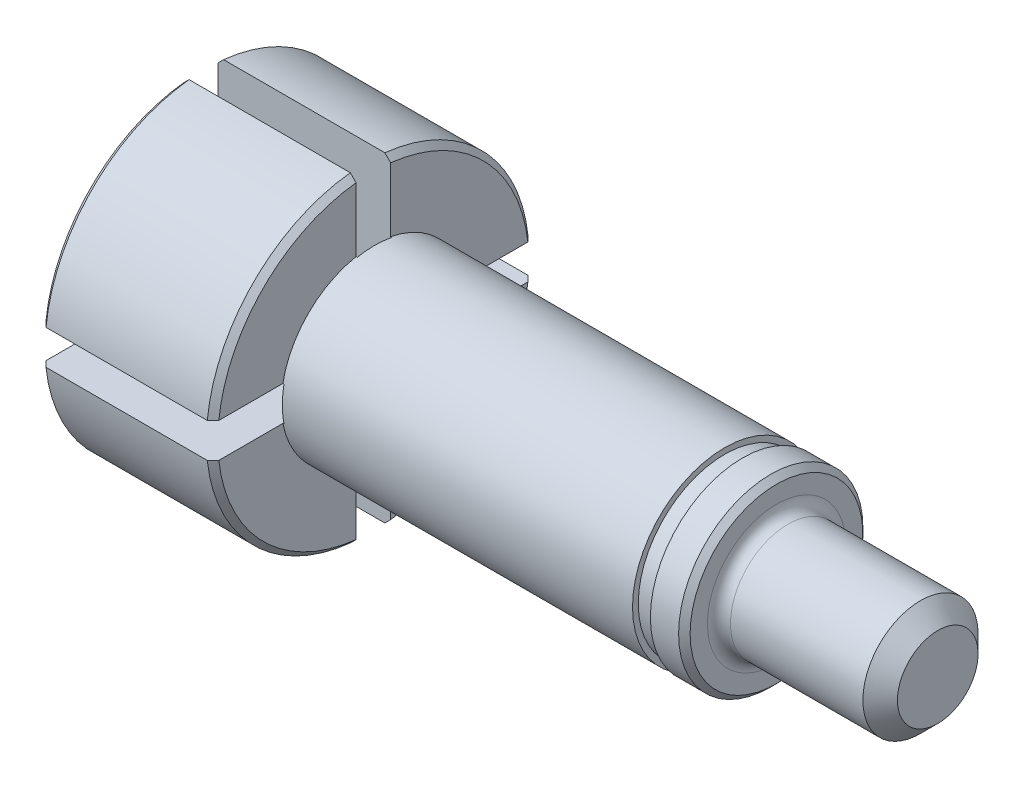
ISO-10303-21;
HEADER;
FILE_DESCRIPTION(('STEP AP214'),'2;1');
FILE_NAME('part.step','',(''),(''),'','','');
FILE_SCHEMA(('AUTOMOTIVE_DESIGN { 1 0 10303 214 1 1 1 1 }'));
ENDSEC;
DATA;
#1=APPLICATION_CONTEXT('core data for automotive mechanical design processes');
#2=APPLICATION_PROTOCOL_DEFINITION('international standard','automotive_design',2000,#1);
#3=PRODUCT_CONTEXT('',#1,'mechanical');
#4=PRODUCT('Part','Part','',(#3));
#5=PRODUCT_RELATED_PRODUCT_CATEGORY('part','',(#4));
#6=PRODUCT_DEFINITION_FORMATION('','',#4);
#7=PRODUCT_DEFINITION_CONTEXT('part definition',#1,'design');
#8=PRODUCT_DEFINITION('design','',#6,#7);
#9=PRODUCT_DEFINITION_SHAPE('','',#8);
#10=(LENGTH_UNIT() NAMED_UNIT(*) SI_UNIT(.MILLI.,.METRE.));
#11=(NAMED_UNIT(*) PLANE_ANGLE_UNIT() SI_UNIT($,.RADIAN.));
#12=(NAMED_UNIT(*) SI_UNIT($,.STERADIAN.) SOLID_ANGLE_UNIT());
#13=UNCERTAINTY_MEASURE_WITH_UNIT(LENGTH_MEASURE(1.E-05),#10,'distance_accuracy_value','');
#14=(GEOMETRIC_REPRESENTATION_CONTEXT(3) GLOBAL_UNCERTAINTY_ASSIGNED_CONTEXT((#13)) GLOBAL_UNIT_ASSIGNED_CONTEXT((#10,
#11,#12)) REPRESENTATION_CONTEXT('',''));
#15=CARTESIAN_POINT('',(0.,0.,0.));
#16=DIRECTION('',(0.,0.,1.));
#17=DIRECTION('',(1.,0.,0.));
#18=AXIS2_PLACEMENT_3D('',#15,#16,#17);
#19=CARTESIAN_POINT('',(15.5,0.,0.));
#20=DIRECTION('',(-1.,0.,0.));
#21=DIRECTION('',(0.,0.,1.));
#22=AXIS2_PLACEMENT_3D('',#19,#20,#21);
#23=CONICAL_SURFACE('',#22,15.,0.785398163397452);
#24=CARTESIAN_POINT('',(6.50402419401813,1.50000000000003,-23.9490470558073));
#25=CARTESIAN_POINT('',(7.40992481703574,1.50000000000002,-23.0413522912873));
#26=CARTESIAN_POINT('',(8.31574269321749,1.50000000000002,-22.1335748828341));
#27=CARTESIAN_POINT('',(10.1270583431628,1.50000000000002,-20.3177523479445));
#28=CARTESIAN_POINT('',(11.0325561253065,1.50000000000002,-19.4097072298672));
#29=CARTESIAN_POINT('',(12.8430575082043,1.50000000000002,-17.5932664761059));
#30=CARTESIAN_POINT('',(13.7480611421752,1.50000000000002,-16.684870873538));
#31=CARTESIAN_POINT('',(15.1050598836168,1.50000000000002,-15.3217493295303));
#32=CARTESIAN_POINT('',(15.5573142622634,1.50000000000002,-14.867281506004));
#33=CARTESIAN_POINT('',(16.4615955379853,1.50000000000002,-13.9581168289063));
#34=CARTESIAN_POINT('',(16.9136224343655,1.50000000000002,-13.5034199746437));
#35=CARTESIAN_POINT('',(17.817442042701,1.50000000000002,-12.5936483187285));
#36=CARTESIAN_POINT('',(18.2692347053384,1.50000000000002,-12.1385734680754));
#37=CARTESIAN_POINT('',(19.1723896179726,1.50000000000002,-11.2280066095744));
#38=CARTESIAN_POINT('',(19.6237518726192,1.50000000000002,-10.7725146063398));
#39=CARTESIAN_POINT('',(20.5258222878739,1.50000000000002,-9.86095959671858));
#40=CARTESIAN_POINT('',(20.9765305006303,1.50000000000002,-9.40489664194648));
#41=CARTESIAN_POINT('',(21.8770360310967,1.50000000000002,-8.49183623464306));
#42=CARTESIAN_POINT('',(22.3268333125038,1.50000000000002,-8.0348387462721));
#43=CARTESIAN_POINT('',(23.0004459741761,1.50000000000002,-7.34814612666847));
#44=CARTESIAN_POINT('',(23.2248362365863,1.50000000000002,-7.1190150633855));
#45=CARTESIAN_POINT('',(23.6730996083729,1.50000000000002,-6.66025245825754));
#46=CARTESIAN_POINT('',(23.8969727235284,1.50000000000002,-6.43062092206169));
#47=CARTESIAN_POINT('',(24.3439923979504,1.50000000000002,-5.97070848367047));
#48=CARTESIAN_POINT('',(24.5671390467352,1.50000000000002,-5.74042766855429));
#49=CARTESIAN_POINT('',(25.0124549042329,1.50000000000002,-5.27890417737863));
#50=CARTESIAN_POINT('',(25.2346240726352,1.50000000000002,-5.04766146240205));
#51=CARTESIAN_POINT('',(25.6776185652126,1.50000000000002,-4.58368572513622));
#52=CARTESIAN_POINT('',(25.8984432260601,1.50000000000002,-4.35095206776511));
#53=CARTESIAN_POINT('',(26.2279485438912,1.50000000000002,-4.00025000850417));
#54=CARTESIAN_POINT('',(26.3374885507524,1.50000000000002,-3.88308943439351));
#55=CARTESIAN_POINT('',(26.5558241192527,1.50000000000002,-3.64807113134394));
#56=CARTESIAN_POINT('',(26.6646196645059,1.50000000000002,-3.5302133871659));
#57=CARTESIAN_POINT('',(26.8812845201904,1.50000000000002,-3.29353517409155));
#58=CARTESIAN_POINT('',(26.9891533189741,1.50000000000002,-3.17471423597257));
#59=CARTESIAN_POINT('',(27.2035470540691,1.50000000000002,-2.93587724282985));
#60=CARTESIAN_POINT('',(27.3100720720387,1.50000000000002,-2.81586126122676));
#61=CARTESIAN_POINT('',(27.521292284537,1.50000000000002,-2.57413555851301));
#62=CARTESIAN_POINT('',(27.625986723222,1.50000000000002,-2.45242517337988));
#63=CARTESIAN_POINT('',(27.7809618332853,1.50000000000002,-2.26809827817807));
#64=CARTESIAN_POINT('',(27.8322809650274,1.50000000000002,-2.20635596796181));
#65=CARTESIAN_POINT('',(27.9340489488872,1.50000000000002,-2.08215223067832));
#66=CARTESIAN_POINT('',(27.9844977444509,1.50000000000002,-2.01969075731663));
#67=CARTESIAN_POINT('',(28.0344192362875,1.50000000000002,-1.95680568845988));
#68=B_SPLINE_CURVE_WITH_KNOTS('',3,(#24,#25,#26,#27,#28,#29,#30,#31,#32,#33,#34,#35,#36,#37,#38,
#39,#40,#41,#42,#43,#44,#45,#46,#47,#48,#49,#50,#51,#52,#53,#54,#55,#56,#57,#58,#59,#60,#61,#62,
#63,#64,#65,#66,#67),.UNSPECIFIED.,.F.,.F.,(4,2,2,2,2,2,2,2,2,2,2,2,2,2,2,2,2,2,2,2,2,4),(0.,
3.8472187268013,7.69432790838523,11.5411350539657,13.4645889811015,15.3880487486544,
17.3118176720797,19.2355655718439,21.1591505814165,23.0828107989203,24.0449267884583,
25.0070319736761,25.9690137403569,26.9310348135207,27.8934972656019,28.3746710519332,
28.8558553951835,29.3372902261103,29.8186956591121,30.3002953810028,30.5411449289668,
30.7820100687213),.UNSPECIFIED.);
#69=CARTESIAN_POINT('',(16.5,1.50000000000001,-13.9194109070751));
#70=VERTEX_POINT('',#69);
#71=CARTESIAN_POINT('',(17.,1.50000000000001,-13.4164078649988));
#72=VERTEX_POINT('',#71);
#73=EDGE_CURVE('E387',#70,#72,#68,.T.);
#74=ORIENTED_EDGE('',*,*,#73,.F.);
#75=CARTESIAN_POINT('',(16.5000000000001,0.,0.));
#76=DIRECTION('',(-1.,0.,0.));
#77=DIRECTION('',(0.,0.,1.));
#78=AXIS2_PLACEMENT_3D('',#75,#76,#77);
#79=CIRCLE('',#78,14.);
#80=CARTESIAN_POINT('',(16.5000000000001,13.9194109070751,-1.5));
#81=VERTEX_POINT('',#80);
#82=EDGE_CURVE('E477',#81,#70,#79,.T.);
#83=ORIENTED_EDGE('',*,*,#82,.F.);
#84=CARTESIAN_POINT('',(28.0344192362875,1.95680568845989,-1.5));
#85=CARTESIAN_POINT('',(27.9593776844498,2.05127615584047,-1.5));
#86=CARTESIAN_POINT('',(27.8831939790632,2.14482144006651,-1.5));
#87=CARTESIAN_POINT('',(27.7290583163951,2.33042439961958,-1.5));
#88=CARTESIAN_POINT('',(27.6511066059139,2.42248227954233,-1.5));
#89=CARTESIAN_POINT('',(27.4939585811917,2.60546577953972,-1.5));
#90=CARTESIAN_POINT('',(27.4147627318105,2.69639180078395,-1.5));
#91=CARTESIAN_POINT('',(27.2553888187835,2.87738442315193,-1.5));
#92=CARTESIAN_POINT('',(27.1752107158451,2.96745098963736,-1.5));
#93=CARTESIAN_POINT('',(26.9336241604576,3.23656052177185,-1.5));
#94=CARTESIAN_POINT('',(26.7710929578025,3.41459454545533,-1.5));
#95=CARTESIAN_POINT('',(26.444115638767,3.76892668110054,-1.5));
#96=CARTESIAN_POINT('',(26.2796692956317,3.94522458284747,-1.5));
#97=CARTESIAN_POINT('',(25.9363109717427,4.31062343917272,-1.5));
#98=CARTESIAN_POINT('',(25.7572917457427,4.49962352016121,-1.5));
#99=CARTESIAN_POINT('',(25.3982100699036,4.87663076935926,-1.5));
#100=CARTESIAN_POINT('',(25.2181476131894,5.06463793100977,-1.5));
#101=CARTESIAN_POINT('',(24.6768456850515,5.62760044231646,-1.5));
#102=CARTESIAN_POINT('',(24.3144982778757,6.00148982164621,-1.5));
#103=CARTESIAN_POINT('',(23.5881482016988,6.74765404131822,-1.5));
#104=CARTESIAN_POINT('',(23.2241455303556,7.11992887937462,-1.5));
#105=CARTESIAN_POINT('',(22.4950971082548,7.86344675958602,-1.5));
#106=CARTESIAN_POINT('',(22.1300513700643,8.23468981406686,-1.5));
#107=CARTESIAN_POINT('',(21.3989947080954,8.97676657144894,-1.5));
#108=CARTESIAN_POINT('',(21.0329832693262,9.34759976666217,-1.5));
#109=CARTESIAN_POINT('',(20.3004707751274,10.088784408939,-1.5));
#110=CARTESIAN_POINT('',(19.9339697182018,10.4591358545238,-1.5));
#111=CARTESIAN_POINT('',(18.8339576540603,11.5696576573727,-1.5));
#112=CARTESIAN_POINT('',(18.0999236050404,12.3093098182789,-1.49999999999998));
#113=CARTESIAN_POINT('',(16.4612533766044,13.9587639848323,-1.49999999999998));
#114=CARTESIAN_POINT('',(15.5564141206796,14.8683641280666,-1.49999999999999));
#115=CARTESIAN_POINT('',(13.7460459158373,16.6868896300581,-1.5));
#116=CARTESIAN_POINT('',(12.8405169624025,17.5958149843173,-1.5));
#117=CARTESIAN_POINT('',(11.0299843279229,19.4122878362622,-1.5));
#118=CARTESIAN_POINT('',(10.1249810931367,20.3198357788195,-1.5));
#119=CARTESIAN_POINT('',(8.31468718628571,22.1346320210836,-1.5));
#120=CARTESIAN_POINT('',(7.40939651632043,23.0418803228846,-1.5));
#121=CARTESIAN_POINT('',(6.50402419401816,23.9490470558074,-1.5));
#122=B_SPLINE_CURVE_WITH_KNOTS('',3,(#84,#85,#86,#87,#88,#89,#90,#91,#92,#93,#94,#95,#96,#97,
#98,#99,#100,#101,#102,#103,#104,#105,#106,#107,#108,#109,#110,#111,#112,#113,#114,#115,#116,
#117,#118,#119,#120,#121),.UNSPECIFIED.,.F.,.F.,(4,2,2,2,2,2,2,2,2,2,2,2,2,2,2,2,2,2,4),(0.,
0.361914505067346,0.723778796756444,1.08551095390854,1.44725762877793,2.17042835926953,
2.8936856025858,3.67465335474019,4.45562625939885,6.01760096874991,7.57957788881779,
9.14153606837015,10.7046524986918,12.2677737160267,15.393955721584,19.2429756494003,
23.09202100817,26.9370264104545,30.7820043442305),.UNSPECIFIED.);
#123=CARTESIAN_POINT('',(17.0000000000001,13.4164078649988,-1.49999999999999));
#124=VERTEX_POINT('',#123);
#125=EDGE_CURVE('E373',#124,#81,#122,.T.);
#126=ORIENTED_EDGE('',*,*,#125,.F.);
#127=CARTESIAN_POINT('',(17.0000000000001,0.,0.));
#128=DIRECTION('',(-1.,0.,0.));
#129=DIRECTION('',(0.,0.,1.));
#130=AXIS2_PLACEMENT_3D('',#127,#128,#129);
#131=CIRCLE('',#130,13.5);
#132=EDGE_CURVE('E405',#124,#72,#131,.T.);
#133=ORIENTED_EDGE('',*,*,#132,.T.);
#134=EDGE_LOOP('',(#74,#83,#126,#133));
#135=FACE_BOUND('',#134,.T.);
#136=ADVANCED_FACE('F31',(#135),#23,.T.);
#137=CARTESIAN_POINT('',(6.50402419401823,23.9490470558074,1.5));
#138=CARTESIAN_POINT('',(7.4099248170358,23.0413522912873,1.50000000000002));
#139=CARTESIAN_POINT('',(8.31574269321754,22.1335748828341,1.50000000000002));
#140=CARTESIAN_POINT('',(10.1270583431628,20.3177523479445,1.50000000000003));
#141=CARTESIAN_POINT('',(11.0325561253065,19.4097072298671,1.50000000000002));
#142=CARTESIAN_POINT('',(12.8430575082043,17.5932664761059,1.50000000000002));
#143=CARTESIAN_POINT('',(13.7480611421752,16.684870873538,1.50000000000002));
#144=CARTESIAN_POINT('',(15.1050598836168,15.3217493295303,1.50000000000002));
#145=CARTESIAN_POINT('',(15.5573142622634,14.867281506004,1.50000000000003));
#146=CARTESIAN_POINT('',(16.4615955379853,13.9581168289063,1.50000000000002));
#147=CARTESIAN_POINT('',(16.9136224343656,13.5034199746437,1.50000000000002));
#148=CARTESIAN_POINT('',(17.8174420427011,12.5936483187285,1.50000000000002));
#149=CARTESIAN_POINT('',(18.2692347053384,12.1385734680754,1.50000000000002));
#150=CARTESIAN_POINT('',(19.1723896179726,11.2280066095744,1.50000000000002));
#151=CARTESIAN_POINT('',(19.6237518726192,10.7725146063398,1.50000000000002));
#152=CARTESIAN_POINT('',(20.5258222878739,9.86095959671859,1.50000000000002));
#153=CARTESIAN_POINT('',(20.9765305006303,9.40489664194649,1.50000000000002));
#154=CARTESIAN_POINT('',(21.8770360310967,8.49183623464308,1.50000000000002));
#155=CARTESIAN_POINT('',(22.3268333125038,8.03483874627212,1.50000000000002));
#156=CARTESIAN_POINT('',(23.0004459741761,7.3481461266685,1.50000000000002));
#157=CARTESIAN_POINT('',(23.2248362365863,7.11901506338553,1.50000000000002));
#158=CARTESIAN_POINT('',(23.6730996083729,6.66025245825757,1.50000000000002));
#159=CARTESIAN_POINT('',(23.8969727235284,6.43062092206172,1.50000000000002));
#160=CARTESIAN_POINT('',(24.3439923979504,5.9707084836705,1.50000000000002));
#161=CARTESIAN_POINT('',(24.5671390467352,5.74042766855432,1.50000000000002));
#162=CARTESIAN_POINT('',(25.0124549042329,5.27890417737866,1.50000000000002));
#163=CARTESIAN_POINT('',(25.2346240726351,5.04766146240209,1.50000000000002));
#164=CARTESIAN_POINT('',(25.6776185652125,4.58368572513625,1.50000000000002));
#165=CARTESIAN_POINT('',(25.8984432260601,4.35095206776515,1.50000000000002));
#166=CARTESIAN_POINT('',(26.2279485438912,4.00025000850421,1.50000000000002));
#167=CARTESIAN_POINT('',(26.3374885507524,3.88308943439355,1.50000000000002));
#168=CARTESIAN_POINT('',(26.5558241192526,3.64807113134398,1.50000000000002));
#169=CARTESIAN_POINT('',(26.6646196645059,3.53021338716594,1.50000000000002));
#170=CARTESIAN_POINT('',(26.8812845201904,3.29353517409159,1.50000000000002));
#171=CARTESIAN_POINT('',(26.9891533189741,3.17471423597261,1.50000000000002));
#172=CARTESIAN_POINT('',(27.2035470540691,2.93587724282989,1.50000000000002));
#173=CARTESIAN_POINT('',(27.3100720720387,2.81586126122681,1.50000000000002));
#174=CARTESIAN_POINT('',(27.5212922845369,2.57413555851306,1.50000000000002));
#175=CARTESIAN_POINT('',(27.6259867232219,2.45242517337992,1.50000000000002));
#176=CARTESIAN_POINT('',(27.7809618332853,2.26809827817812,1.50000000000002));
#177=CARTESIAN_POINT('',(27.8322809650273,2.20635596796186,1.50000000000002));
#178=CARTESIAN_POINT('',(27.9340489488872,2.08215223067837,1.50000000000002));
#179=CARTESIAN_POINT('',(27.9844977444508,2.01969075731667,1.50000000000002));
#180=CARTESIAN_POINT('',(28.0344192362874,1.95680568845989,1.50000000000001));
#181=B_SPLINE_CURVE_WITH_KNOTS('',3,(#137,#138,#139,#140,#141,#142,#143,#144,#145,#146,#147,
#148,#149,#150,#151,#152,#153,#154,#155,#156,#157,#158,#159,#160,#161,#162,#163,#164,#165,#166,
#167,#168,#169,#170,#171,#172,#173,#174,#175,#176,#177,#178,#179,#180),.UNSPECIFIED.,.F.,.F.,(4,
2,2,2,2,2,2,2,2,2,2,2,2,2,2,2,2,2,2,2,2,4),(0.,3.84721872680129,7.6943279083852,
11.5411350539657,13.4645889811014,15.3880487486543,17.3118176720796,19.2355655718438,
21.1591505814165,23.0828107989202,24.0449267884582,25.007031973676,25.9690137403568,
26.9310348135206,27.8934972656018,28.3746710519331,28.8558553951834,29.3372902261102,
29.818695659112,30.3002953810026,30.5411449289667,30.7820100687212),.UNSPECIFIED.);
#182=CARTESIAN_POINT('',(16.5000000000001,13.9194109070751,1.50000000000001));
#183=VERTEX_POINT('',#182);
#184=CARTESIAN_POINT('',(17.0000000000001,13.4164078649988,1.50000000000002));
#185=VERTEX_POINT('',#184);
#186=EDGE_CURVE('E601',#183,#185,#181,.T.);
#187=ORIENTED_EDGE('',*,*,#186,.F.);
#188=CARTESIAN_POINT('',(16.5,1.5,13.9194109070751));
#189=VERTEX_POINT('',#188);
#190=EDGE_CURVE('E307',#189,#183,#79,.T.);
#191=ORIENTED_EDGE('',*,*,#190,.F.);
#192=CARTESIAN_POINT('',(28.0344192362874,1.50000000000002,1.95680568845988));
#193=CARTESIAN_POINT('',(27.9593776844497,1.50000000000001,2.05127615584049));
#194=CARTESIAN_POINT('',(27.8831939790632,1.50000000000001,2.14482144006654));
#195=CARTESIAN_POINT('',(27.7290583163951,1.50000000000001,2.33042439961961));
#196=CARTESIAN_POINT('',(27.6511066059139,1.50000000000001,2.42248227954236));
#197=CARTESIAN_POINT('',(27.4939585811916,1.50000000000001,2.60546577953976));
#198=CARTESIAN_POINT('',(27.4147627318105,1.50000000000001,2.69639180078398));
#199=CARTESIAN_POINT('',(27.2553888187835,1.50000000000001,2.87738442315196));
#200=CARTESIAN_POINT('',(27.1752107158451,1.50000000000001,2.9674509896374));
#201=CARTESIAN_POINT('',(26.9336241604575,1.50000000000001,3.23656052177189));
#202=CARTESIAN_POINT('',(26.7710929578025,1.50000000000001,3.41459454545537));
#203=CARTESIAN_POINT('',(26.4441156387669,1.50000000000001,3.76892668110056));
#204=CARTESIAN_POINT('',(26.2796692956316,1.50000000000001,3.94522458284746));
#205=CARTESIAN_POINT('',(25.9363109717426,1.50000000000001,4.31062343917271));
#206=CARTESIAN_POINT('',(25.7572917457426,1.50000000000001,4.49962352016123));
#207=CARTESIAN_POINT('',(25.3982100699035,1.50000000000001,4.87663076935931));
#208=CARTESIAN_POINT('',(25.2181476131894,1.50000000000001,5.06463793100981));
#209=CARTESIAN_POINT('',(24.6768456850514,1.50000000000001,5.62760044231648));
#210=CARTESIAN_POINT('',(24.3144982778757,1.50000000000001,6.00148982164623));
#211=CARTESIAN_POINT('',(23.5881482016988,1.50000000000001,6.74765404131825));
#212=CARTESIAN_POINT('',(23.2241455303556,1.50000000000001,7.11992887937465));
#213=CARTESIAN_POINT('',(22.4950971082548,1.50000000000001,7.86344675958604));
#214=CARTESIAN_POINT('',(22.1300513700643,1.50000000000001,8.23468981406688));
#215=CARTESIAN_POINT('',(21.3989947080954,1.50000000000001,8.97676657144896));
#216=CARTESIAN_POINT('',(21.0329832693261,1.50000000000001,9.34759976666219));
#217=CARTESIAN_POINT('',(20.3004707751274,1.50000000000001,10.088784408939));
#218=CARTESIAN_POINT('',(19.9339697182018,1.50000000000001,10.4591358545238));
#219=CARTESIAN_POINT('',(18.8339576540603,1.50000000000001,11.5696576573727));
#220=CARTESIAN_POINT('',(18.0999236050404,1.50000000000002,12.3093098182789));
#221=CARTESIAN_POINT('',(16.4612533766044,1.50000000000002,13.9587639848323));
#222=CARTESIAN_POINT('',(15.5564141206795,1.50000000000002,14.8683641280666));
#223=CARTESIAN_POINT('',(13.7460459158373,1.50000000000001,16.6868896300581));
#224=CARTESIAN_POINT('',(12.8405169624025,1.50000000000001,17.5958149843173));
#225=CARTESIAN_POINT('',(11.0299843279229,1.50000000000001,19.4122878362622));
#226=CARTESIAN_POINT('',(10.1249810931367,1.50000000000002,20.3198357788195));
#227=CARTESIAN_POINT('',(8.31468718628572,1.50000000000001,22.1346320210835));
#228=CARTESIAN_POINT('',(7.40939651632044,1.50000000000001,23.0418803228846));
#229=CARTESIAN_POINT('',(6.50402419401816,1.5,23.9490470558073));
#230=B_SPLINE_CURVE_WITH_KNOTS('',3,(#192,#193,#194,#195,#196,#197,#198,#199,#200,#201,#202,
#203,#204,#205,#206,#207,#208,#209,#210,#211,#212,#213,#214,#215,#216,#217,#218,#219,#220,#221,
#222,#223,#224,#225,#226,#227,#228,#229),.UNSPECIFIED.,.F.,.F.,(4,2,2,2,2,2,2,2,2,2,2,2,2,2,2,2,
2,2,4),(0.,0.361914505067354,0.723778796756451,1.08551095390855,1.44725762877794,
2.17042835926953,2.89368560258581,3.67465335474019,4.45562625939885,6.01760096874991,
7.57957788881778,9.14153606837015,10.7046524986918,12.2677737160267,15.3939557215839,
19.2429756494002,23.0920210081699,26.9370264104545,30.7820043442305),.UNSPECIFIED.);
#231=CARTESIAN_POINT('',(17.,1.50000000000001,13.4164078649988));
#232=VERTEX_POINT('',#231);
#233=EDGE_CURVE('E589',#232,#189,#230,.T.);
#234=ORIENTED_EDGE('',*,*,#233,.F.);
#235=EDGE_CURVE('E401',#232,#185,#131,.T.);
#236=ORIENTED_EDGE('',*,*,#235,.T.);
#237=EDGE_LOOP('',(#187,#191,#234,#236));
#238=FACE_BOUND('',#237,.T.);
#239=ADVANCED_FACE('F608',(#238),#23,.T.);
#240=CARTESIAN_POINT('',(6.50402419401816,-1.5,23.9490470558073));
#241=CARTESIAN_POINT('',(7.40992481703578,-1.5,23.0413522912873));
#242=CARTESIAN_POINT('',(8.31574269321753,-1.5,22.133574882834));
#243=CARTESIAN_POINT('',(10.1270583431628,-1.5,20.3177523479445));
#244=CARTESIAN_POINT('',(11.0325561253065,-1.5,19.4097072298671));
#245=CARTESIAN_POINT('',(12.8430575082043,-1.5,17.5932664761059));
#246=CARTESIAN_POINT('',(13.7480611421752,-1.49999999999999,16.684870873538));
#247=CARTESIAN_POINT('',(15.1050598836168,-1.5,15.3217493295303));
#248=CARTESIAN_POINT('',(15.5573142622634,-1.5,14.867281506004));
#249=CARTESIAN_POINT('',(16.4615955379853,-1.49999999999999,13.9581168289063));
#250=CARTESIAN_POINT('',(16.9136224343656,-1.49999999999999,13.5034199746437));
#251=CARTESIAN_POINT('',(17.8174420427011,-1.49999999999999,12.5936483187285));
#252=CARTESIAN_POINT('',(18.2692347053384,-1.49999999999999,12.1385734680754));
#253=CARTESIAN_POINT('',(19.1723896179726,-1.5,11.2280066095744));
#254=CARTESIAN_POINT('',(19.6237518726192,-1.5,10.7725146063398));
#255=CARTESIAN_POINT('',(20.5258222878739,-1.5,9.86095959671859));
#256=CARTESIAN_POINT('',(20.9765305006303,-1.5,9.40489664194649));
#257=CARTESIAN_POINT('',(21.8770360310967,-1.5,8.49183623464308));
#258=CARTESIAN_POINT('',(22.3268333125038,-1.5,8.03483874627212));
#259=CARTESIAN_POINT('',(23.0004459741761,-1.5,7.3481461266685));
#260=CARTESIAN_POINT('',(23.2248362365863,-1.5,7.11901506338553));
#261=CARTESIAN_POINT('',(23.6730996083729,-1.5,6.66025245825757));
#262=CARTESIAN_POINT('',(23.8969727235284,-1.5,6.43062092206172));
#263=CARTESIAN_POINT('',(24.3439923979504,-1.5,5.9707084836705));
#264=CARTESIAN_POINT('',(24.5671390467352,-1.5,5.74042766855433));
#265=CARTESIAN_POINT('',(25.0124549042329,-1.5,5.27890417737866));
#266=CARTESIAN_POINT('',(25.2346240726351,-1.5,5.04766146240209));
#267=CARTESIAN_POINT('',(25.6776185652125,-1.5,4.58368572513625));
#268=CARTESIAN_POINT('',(25.8984432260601,-1.5,4.35095206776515));
#269=CARTESIAN_POINT('',(26.2279485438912,-1.5,4.00025000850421));
#270=CARTESIAN_POINT('',(26.3374885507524,-1.5,3.88308943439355));
#271=CARTESIAN_POINT('',(26.5558241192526,-1.5,3.64807113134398));
#272=CARTESIAN_POINT('',(26.6646196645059,-1.5,3.53021338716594));
#273=CARTESIAN_POINT('',(26.8812845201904,-1.5,3.29353517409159));
#274=CARTESIAN_POINT('',(26.9891533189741,-1.5,3.17471423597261));
#275=CARTESIAN_POINT('',(27.2035470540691,-1.5,2.9358772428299));
#276=CARTESIAN_POINT('',(27.3100720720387,-1.5,2.81586126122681));
#277=CARTESIAN_POINT('',(27.5212922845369,-1.5,2.57413555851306));
#278=CARTESIAN_POINT('',(27.6259867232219,-1.5,2.45242517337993));
#279=CARTESIAN_POINT('',(27.7809618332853,-1.5,2.26809827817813));
#280=CARTESIAN_POINT('',(27.8322809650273,-1.5,2.20635596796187));
#281=CARTESIAN_POINT('',(27.9340489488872,-1.5,2.08215223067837));
#282=CARTESIAN_POINT('',(27.9844977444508,-1.5,2.01969075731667));
#283=CARTESIAN_POINT('',(28.0344192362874,-1.49999999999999,1.95680568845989));
#284=B_SPLINE_CURVE_WITH_KNOTS('',3,(#240,#241,#242,#243,#244,#245,#246,#247,#248,#249,#250,
#251,#252,#253,#254,#255,#256,#257,#258,#259,#260,#261,#262,#263,#264,#265,#266,#267,#268,#269,
#270,#271,#272,#273,#274,#275,#276,#277,#278,#279,#280,#281,#282,#283),.UNSPECIFIED.,.F.,.F.,(4,
2,2,2,2,2,2,2,2,2,2,2,2,2,2,2,2,2,2,2,2,4),(0.,3.8472187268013,7.69432790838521,
11.5411350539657,13.4645889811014,15.3880487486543,17.3118176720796,19.2355655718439,
21.1591505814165,23.0828107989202,24.0449267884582,25.007031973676,25.9690137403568,
26.9310348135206,27.8934972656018,28.3746710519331,28.8558553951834,29.3372902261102,
29.818695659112,30.3002953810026,30.5411449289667,30.7820100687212),.UNSPECIFIED.);
#285=CARTESIAN_POINT('',(16.5,-1.5,13.9194109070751));
#286=VERTEX_POINT('',#285);
#287=CARTESIAN_POINT('',(17.0000000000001,-1.49999999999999,13.4164078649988));
#288=VERTEX_POINT('',#287);
#289=EDGE_CURVE('E497',#286,#288,#284,.T.);
#290=ORIENTED_EDGE('',*,*,#289,.F.);
#291=CARTESIAN_POINT('',(16.5,-13.9194109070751,1.50000000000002));
#292=VERTEX_POINT('',#291);
#293=EDGE_CURVE('E435',#292,#286,#79,.T.);
#294=ORIENTED_EDGE('',*,*,#293,.F.);
#295=CARTESIAN_POINT('',(28.0344192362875,-1.95680568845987,1.50000000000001));
#296=CARTESIAN_POINT('',(27.9593776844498,-2.05127615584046,1.50000000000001));
#297=CARTESIAN_POINT('',(27.8831939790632,-2.14482144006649,1.50000000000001));
#298=CARTESIAN_POINT('',(27.7290583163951,-2.33042439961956,1.50000000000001));
#299=CARTESIAN_POINT('',(27.6511066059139,-2.42248227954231,1.50000000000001));
#300=CARTESIAN_POINT('',(27.4939585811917,-2.60546577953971,1.50000000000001));
#301=CARTESIAN_POINT('',(27.4147627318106,-2.69639180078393,1.50000000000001));
#302=CARTESIAN_POINT('',(27.2553888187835,-2.87738442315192,1.50000000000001));
#303=CARTESIAN_POINT('',(27.1752107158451,-2.96745098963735,1.50000000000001));
#304=CARTESIAN_POINT('',(26.9336241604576,-3.23656052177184,1.50000000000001));
#305=CARTESIAN_POINT('',(26.7710929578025,-3.41459454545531,1.50000000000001));
#306=CARTESIAN_POINT('',(26.444115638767,-3.76892668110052,1.5));
#307=CARTESIAN_POINT('',(26.2796692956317,-3.94522458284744,1.5));
#308=CARTESIAN_POINT('',(25.9363109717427,-4.31062343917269,1.5));
#309=CARTESIAN_POINT('',(25.7572917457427,-4.49962352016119,1.5));
#310=CARTESIAN_POINT('',(25.3982100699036,-4.87663076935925,1.50000000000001));
#311=CARTESIAN_POINT('',(25.2181476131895,-5.06463793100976,1.50000000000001));
#312=CARTESIAN_POINT('',(24.6768456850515,-5.62760044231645,1.50000000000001));
#313=CARTESIAN_POINT('',(24.3144982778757,-6.00148982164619,1.50000000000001));
#314=CARTESIAN_POINT('',(23.5881482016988,-6.74765404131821,1.50000000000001));
#315=CARTESIAN_POINT('',(23.2241455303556,-7.11992887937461,1.50000000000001));
#316=CARTESIAN_POINT('',(22.4950971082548,-7.86344675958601,1.50000000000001));
#317=CARTESIAN_POINT('',(22.1300513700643,-8.23468981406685,1.50000000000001));
#318=CARTESIAN_POINT('',(21.3989947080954,-8.97676657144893,1.50000000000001));
#319=CARTESIAN_POINT('',(21.0329832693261,-9.34759976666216,1.50000000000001));
#320=CARTESIAN_POINT('',(20.3004707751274,-10.088784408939,1.50000000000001));
#321=CARTESIAN_POINT('',(19.9339697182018,-10.4591358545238,1.50000000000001));
#322=CARTESIAN_POINT('',(18.8339576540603,-11.5696576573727,1.50000000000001));
#323=CARTESIAN_POINT('',(18.0999236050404,-12.3093098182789,1.50000000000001));
#324=CARTESIAN_POINT('',(16.4612533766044,-13.9587639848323,1.50000000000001));
#325=CARTESIAN_POINT('',(15.5564141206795,-14.8683641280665,1.50000000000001));
#326=CARTESIAN_POINT('',(13.7460459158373,-16.6868896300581,1.50000000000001));
#327=CARTESIAN_POINT('',(12.8405169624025,-17.5958149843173,1.50000000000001));
#328=CARTESIAN_POINT('',(11.0299843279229,-19.4122878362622,1.50000000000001));
#329=CARTESIAN_POINT('',(10.1249810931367,-20.3198357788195,1.50000000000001));
#330=CARTESIAN_POINT('',(8.31468718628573,-22.1346320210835,1.50000000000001));
#331=CARTESIAN_POINT('',(7.40939651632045,-23.0418803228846,1.5));
#332=CARTESIAN_POINT('',(6.50402419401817,-23.9490470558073,1.49999999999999));
#333=B_SPLINE_CURVE_WITH_KNOTS('',3,(#295,#296,#297,#298,#299,#300,#301,#302,#303,#304,#305,
#306,#307,#308,#309,#310,#311,#312,#313,#314,#315,#316,#317,#318,#319,#320,#321,#322,#323,#324,
#325,#326,#327,#328,#329,#330,#331,#332),.UNSPECIFIED.,.F.,.F.,(4,2,2,2,2,2,2,2,2,2,2,2,2,2,2,2,
2,2,4),(0.,0.361914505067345,0.723778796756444,1.08551095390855,1.44725762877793,
2.17042835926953,2.8936856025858,3.67465335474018,4.45562625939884,6.01760096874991,
7.57957788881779,9.14153606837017,10.7046524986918,12.2677737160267,15.393955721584,
19.2429756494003,23.09202100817,26.9370264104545,30.7820043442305),.UNSPECIFIED.);
#334=CARTESIAN_POINT('',(17.,-13.4164078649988,1.50000000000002));
#335=VERTEX_POINT('',#334);
#336=EDGE_CURVE('E495',#335,#292,#333,.T.);
#337=ORIENTED_EDGE('',*,*,#336,.F.);
#338=EDGE_CURVE('E399',#335,#288,#131,.T.);
#339=ORIENTED_EDGE('',*,*,#338,.T.);
#340=EDGE_LOOP('',(#290,#294,#337,#339));
#341=FACE_BOUND('',#340,.T.);
#342=ADVANCED_FACE('F493',(#341),#23,.T.);
#343=CARTESIAN_POINT('',(17.0000000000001,13.5000000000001,0.));
#344=DIRECTION('',(1.,0.,0.));
#345=DIRECTION('',(0.,0.,-1.));
#346=AXIS2_PLACEMENT_3D('',#343,#344,#345);
#347=PLANE('',#346);
#348=DIRECTION('',(0.,0.,1.));
#349=VECTOR('',#348,1.);
#350=CARTESIAN_POINT('',(17.0000000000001,1.50000000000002,0.));
#351=LINE('',#350,#349);
#352=CARTESIAN_POINT('',(17.,1.50000000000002,-7.85811682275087));
#353=VERTEX_POINT('',#352);
#354=EDGE_CURVE('E55',#72,#353,#351,.T.);
#355=ORIENTED_EDGE('',*,*,#354,.F.);
#356=ORIENTED_EDGE('',*,*,#132,.F.);
#357=DIRECTION('',(0.,1.,0.));
#358=VECTOR('',#357,1.);
#359=CARTESIAN_POINT('',(17.0000000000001,13.5,-1.5));
#360=LINE('',#359,#358);
#361=CARTESIAN_POINT('',(17.,7.85811682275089,-1.5));
#362=VERTEX_POINT('',#361);
#363=EDGE_CURVE('E379',#362,#124,#360,.T.);
#364=ORIENTED_EDGE('',*,*,#363,.F.);
#365=CARTESIAN_POINT('',(17.0000000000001,0.,0.));
#366=DIRECTION('',(-1.,0.,0.));
#367=DIRECTION('',(0.,0.,1.));
#368=AXIS2_PLACEMENT_3D('',#365,#366,#367);
#369=CIRCLE('',#368,8.);
#370=EDGE_CURVE('E400',#362,#353,#369,.T.);
#371=ORIENTED_EDGE('',*,*,#370,.T.);
#372=EDGE_LOOP('',(#355,#356,#364,#371));
#373=FACE_BOUND('',#372,.T.);
#374=ADVANCED_FACE('F551',(#373),#347,.T.);
#375=DIRECTION('',(0.,-1.,0.));
#376=VECTOR('',#375,1.);
#377=CARTESIAN_POINT('',(17.0000000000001,13.5000000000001,1.50000000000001));
#378=LINE('',#377,#376);
#379=CARTESIAN_POINT('',(17.,7.85811682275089,1.50000000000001));
#380=VERTEX_POINT('',#379);
#381=EDGE_CURVE('E579',#185,#380,#378,.T.);
#382=ORIENTED_EDGE('',*,*,#381,.F.);
#383=ORIENTED_EDGE('',*,*,#235,.F.);
#384=DIRECTION('',(0.,0.,1.));
#385=VECTOR('',#384,1.);
#386=CARTESIAN_POINT('',(17.0000000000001,1.50000000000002,0.));
#387=LINE('',#386,#385);
#388=CARTESIAN_POINT('',(17.0000000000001,1.50000000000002,7.85811682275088));
#389=VERTEX_POINT('',#388);
#390=EDGE_CURVE('E585',#389,#232,#387,.T.);
#391=ORIENTED_EDGE('',*,*,#390,.F.);
#392=EDGE_CURVE('E396',#389,#380,#369,.T.);
#393=ORIENTED_EDGE('',*,*,#392,.T.);
#394=EDGE_LOOP('',(#382,#383,#391,#393));
#395=FACE_BOUND('',#394,.T.);
#396=ADVANCED_FACE('F583',(#395),#347,.T.);
#397=DIRECTION('',(0.,0.,-1.));
#398=VECTOR('',#397,1.);
#399=CARTESIAN_POINT('',(17.0000000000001,-1.49999999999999,0.));
#400=LINE('',#399,#398);
#401=CARTESIAN_POINT('',(17.0000000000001,-1.49999999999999,7.85811682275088));
#402=VERTEX_POINT('',#401);
#403=EDGE_CURVE('E499',#288,#402,#400,.T.);
#404=ORIENTED_EDGE('',*,*,#403,.F.);
#405=ORIENTED_EDGE('',*,*,#338,.F.);
#406=DIRECTION('',(0.,-1.,0.));
#407=VECTOR('',#406,1.);
#408=CARTESIAN_POINT('',(17.0000000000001,13.5000000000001,1.50000000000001));
#409=LINE('',#408,#407);
#410=CARTESIAN_POINT('',(17.0000000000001,-7.85811682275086,1.5));
#411=VERTEX_POINT('',#410);
#412=EDGE_CURVE('E526',#411,#335,#409,.T.);
#413=ORIENTED_EDGE('',*,*,#412,.F.);
#414=EDGE_CURVE('E395',#411,#402,#369,.T.);
#415=ORIENTED_EDGE('',*,*,#414,.T.);
#416=EDGE_LOOP('',(#404,#405,#413,#415));
#417=FACE_BOUND('',#416,.T.);
#418=ADVANCED_FACE('F536',(#417),#347,.T.);
#419=CARTESIAN_POINT('',(-1.60406885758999,0.,0.));
#420=DIRECTION('',(-1.,0.,0.));
#421=DIRECTION('',(0.,0.,1.));
#422=AXIS2_PLACEMENT_3D('',#419,#420,#421);
#423=CYLINDRICAL_SURFACE('',#422,14.);
#424=DIRECTION('',(-1.,0.,0.));
#425=VECTOR('',#424,1.);
#426=CARTESIAN_POINT('',(-1.60406885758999,1.50000000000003,-13.9194109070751));
#427=LINE('',#426,#425);
#428=CARTESIAN_POINT('',(2.5,1.50000000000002,-13.9194109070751));
#429=VERTEX_POINT('',#428);
#430=EDGE_CURVE('E385',#429,#70,#427,.F.);
#431=ORIENTED_EDGE('',*,*,#430,.F.);
#432=CARTESIAN_POINT('',(2.5,0.,0.));
#433=DIRECTION('',(-1.,0.,0.));
#434=DIRECTION('',(0.,0.,1.));
#435=AXIS2_PLACEMENT_3D('',#432,#433,#434);
#436=CIRCLE('',#435,14.);
#437=CARTESIAN_POINT('',(2.5,13.9194109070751,-1.49999999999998));
#438=VERTEX_POINT('',#437);
#439=EDGE_CURVE('E439',#438,#429,#436,.T.);
#440=ORIENTED_EDGE('',*,*,#439,.F.);
#441=DIRECTION('',(-1.,0.,0.));
#442=VECTOR('',#441,1.);
#443=CARTESIAN_POINT('',(-1.60406885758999,13.9194109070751,-1.5));
#444=LINE('',#443,#442);
#445=EDGE_CURVE('E380',#81,#438,#444,.T.);
#446=ORIENTED_EDGE('',*,*,#445,.F.);
#447=ORIENTED_EDGE('',*,*,#82,.T.);
#448=EDGE_LOOP('',(#431,#440,#446,#447));
#449=FACE_BOUND('',#448,.T.);
#450=ADVANCED_FACE('F633',(#449),#423,.T.);
#451=DIRECTION('',(-1.,0.,0.));
#452=VECTOR('',#451,1.);
#453=CARTESIAN_POINT('',(-1.60406885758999,13.9194109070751,1.50000000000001));
#454=LINE('',#453,#452);
#455=CARTESIAN_POINT('',(2.5,13.9194109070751,1.50000000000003));
#456=VERTEX_POINT('',#455);
#457=EDGE_CURVE('E591',#456,#183,#454,.F.);
#458=ORIENTED_EDGE('',*,*,#457,.F.);
#459=CARTESIAN_POINT('',(2.5000000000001,1.5,13.9194109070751));
#460=VERTEX_POINT('',#459);
#461=EDGE_CURVE('E436',#460,#456,#436,.T.);
#462=ORIENTED_EDGE('',*,*,#461,.F.);
#463=DIRECTION('',(-1.,0.,0.));
#464=VECTOR('',#463,1.);
#465=CARTESIAN_POINT('',(-1.60406885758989,1.50000000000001,13.9194109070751));
#466=LINE('',#465,#464);
#467=EDGE_CURVE('E593',#189,#460,#466,.T.);
#468=ORIENTED_EDGE('',*,*,#467,.F.);
#469=ORIENTED_EDGE('',*,*,#190,.T.);
#470=EDGE_LOOP('',(#458,#462,#468,#469));
#471=FACE_BOUND('',#470,.T.);
#472=ADVANCED_FACE('F611',(#471),#423,.T.);
#473=DIRECTION('',(-1.,0.,0.));
#474=VECTOR('',#473,1.);
#475=CARTESIAN_POINT('',(-1.60406885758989,-1.5,13.9194109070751));
#476=LINE('',#475,#474);
#477=CARTESIAN_POINT('',(2.5000000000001,-1.5,13.9194109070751));
#478=VERTEX_POINT('',#477);
#479=EDGE_CURVE('E488',#478,#286,#476,.F.);
#480=ORIENTED_EDGE('',*,*,#479,.F.);
#481=CARTESIAN_POINT('',(2.50000000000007,-13.9194109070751,1.50000000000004));
#482=VERTEX_POINT('',#481);
#483=EDGE_CURVE('E440',#482,#478,#436,.T.);
#484=ORIENTED_EDGE('',*,*,#483,.F.);
#485=DIRECTION('',(-1.,0.,0.));
#486=VECTOR('',#485,1.);
#487=CARTESIAN_POINT('',(-1.60406885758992,-13.9194109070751,1.50000000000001));
#488=LINE('',#487,#486);
#489=EDGE_CURVE('E489',#292,#482,#488,.T.);
#490=ORIENTED_EDGE('',*,*,#489,.F.);
#491=ORIENTED_EDGE('',*,*,#293,.T.);
#492=EDGE_LOOP('',(#480,#484,#490,#491));
#493=FACE_BOUND('',#492,.T.);
#494=ADVANCED_FACE('F487',(#493),#423,.T.);
#495=CARTESIAN_POINT('',(2.,0.,0.));
#496=DIRECTION('',(-1.,0.,0.));
#497=DIRECTION('',(0.,0.,1.));
#498=AXIS2_PLACEMENT_3D('',#495,#496,#497);
#499=PLANE('',#498);
#500=DIRECTION('',(0.,0.,-1.));
#501=VECTOR('',#500,1.);
#502=CARTESIAN_POINT('',(2.,1.50000000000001,-15.929532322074));
#503=LINE('',#502,#501);
#504=CARTESIAN_POINT('',(2.,1.50000000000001,-1.5));
#505=VERTEX_POINT('',#504);
#506=CARTESIAN_POINT('',(2.00000000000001,1.50000000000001,-13.4164078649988));
#507=VERTEX_POINT('',#506);
#508=EDGE_CURVE('E250',#505,#507,#503,.T.);
#509=ORIENTED_EDGE('',*,*,#508,.F.);
#510=DIRECTION('',(0.,-1.,0.));
#511=VECTOR('',#510,1.);
#512=CARTESIAN_POINT('',(2.,15.929532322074,-1.49999999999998));
#513=LINE('',#512,#511);
#514=CARTESIAN_POINT('',(2.,13.4164078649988,-1.49999999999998));
#515=VERTEX_POINT('',#514);
#516=EDGE_CURVE('E248',#515,#505,#513,.T.);
#517=ORIENTED_EDGE('',*,*,#516,.F.);
#518=CARTESIAN_POINT('',(2.,0.,0.));
#519=DIRECTION('',(-1.,0.,0.));
#520=DIRECTION('',(0.,0.,1.));
#521=AXIS2_PLACEMENT_3D('',#518,#519,#520);
#522=CIRCLE('',#521,13.5);
#523=EDGE_CURVE('E442',#515,#507,#522,.T.);
#524=ORIENTED_EDGE('',*,*,#523,.T.);
#525=EDGE_LOOP('',(#509,#517,#524));
#526=FACE_BOUND('',#525,.T.);
#527=ADVANCED_FACE('F567',(#526),#499,.T.);
#528=DIRECTION('',(0.,1.,0.));
#529=VECTOR('',#528,1.);
#530=CARTESIAN_POINT('',(2.,15.929532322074,1.50000000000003));
#531=LINE('',#530,#529);
#532=CARTESIAN_POINT('',(2.,1.50000000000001,1.50000000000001));
#533=VERTEX_POINT('',#532);
#534=CARTESIAN_POINT('',(2.,13.4164078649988,1.50000000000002));
#535=VERTEX_POINT('',#534);
#536=EDGE_CURVE('E246',#533,#535,#531,.T.);
#537=ORIENTED_EDGE('',*,*,#536,.F.);
#538=DIRECTION('',(0.,0.,-1.));
#539=VECTOR('',#538,1.);
#540=CARTESIAN_POINT('',(2.,1.50000000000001,1.50000000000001));
#541=LINE('',#540,#539);
#542=CARTESIAN_POINT('',(2.0000000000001,1.5,13.4164078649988));
#543=VERTEX_POINT('',#542);
#544=EDGE_CURVE('E244',#543,#533,#541,.T.);
#545=ORIENTED_EDGE('',*,*,#544,.F.);
#546=EDGE_CURVE('E306',#543,#535,#522,.T.);
#547=ORIENTED_EDGE('',*,*,#546,.T.);
#548=EDGE_LOOP('',(#537,#545,#547));
#549=FACE_BOUND('',#548,.T.);
#550=ADVANCED_FACE('F691',(#549),#499,.T.);
#551=DIRECTION('',(0.,0.,1.));
#552=VECTOR('',#551,1.);
#553=CARTESIAN_POINT('',(2.,-1.49999999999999,1.50000000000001));
#554=LINE('',#553,#552);
#555=CARTESIAN_POINT('',(2.,-1.49999999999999,1.50000000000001));
#556=VERTEX_POINT('',#555);
#557=CARTESIAN_POINT('',(2.,-1.5,13.4164078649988));
#558=VERTEX_POINT('',#557);
#559=EDGE_CURVE('E240',#556,#558,#554,.T.);
#560=ORIENTED_EDGE('',*,*,#559,.F.);
#561=DIRECTION('',(0.,1.,0.));
#562=VECTOR('',#561,1.);
#563=CARTESIAN_POINT('',(2.,-1.49999999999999,1.50000000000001));
#564=LINE('',#563,#562);
#565=CARTESIAN_POINT('',(2.00000000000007,-13.4164078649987,1.50000000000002));
#566=VERTEX_POINT('',#565);
#567=EDGE_CURVE('E238',#566,#556,#564,.T.);
#568=ORIENTED_EDGE('',*,*,#567,.F.);
#569=EDGE_CURVE('E438',#566,#558,#522,.T.);
#570=ORIENTED_EDGE('',*,*,#569,.T.);
#571=EDGE_LOOP('',(#560,#568,#570));
#572=FACE_BOUND('',#571,.T.);
#573=ADVANCED_FACE('F453',(#572),#499,.T.);
#574=CARTESIAN_POINT('',(2.,0.,0.));
#575=DIRECTION('',(1.,0.,0.));
#576=DIRECTION('',(0.,0.,-1.));
#577=AXIS2_PLACEMENT_3D('',#574,#575,#576);
#578=CONICAL_SURFACE('',#577,13.5,0.785398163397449);
#579=CARTESIAN_POINT('',(-9.0344192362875,1.50000000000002,-1.9568056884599));
#580=CARTESIAN_POINT('',(-8.9593776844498,1.50000000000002,-2.05127615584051));
#581=CARTESIAN_POINT('',(-8.88319397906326,1.50000000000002,-2.14482144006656));
#582=CARTESIAN_POINT('',(-8.72905831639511,1.50000000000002,-2.33042439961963));
#583=CARTESIAN_POINT('',(-8.65110660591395,1.50000000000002,-2.42248227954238));
#584=CARTESIAN_POINT('',(-8.49395858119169,1.50000000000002,-2.60546577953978));
#585=CARTESIAN_POINT('',(-8.41476273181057,1.50000000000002,-2.696391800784));
#586=CARTESIAN_POINT('',(-8.25538881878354,1.50000000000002,-2.87738442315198));
#587=CARTESIAN_POINT('',(-8.17521071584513,1.50000000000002,-2.96745098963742));
#588=CARTESIAN_POINT('',(-7.9336241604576,1.50000000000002,-3.23656052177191));
#589=CARTESIAN_POINT('',(-7.77109295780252,1.50000000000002,-3.41459454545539));
#590=CARTESIAN_POINT('',(-7.44411563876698,1.50000000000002,-3.76892668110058));
#591=CARTESIAN_POINT('',(-7.27966929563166,1.50000000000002,-3.94522458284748));
#592=CARTESIAN_POINT('',(-6.93631097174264,1.50000000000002,-4.31062343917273));
#593=CARTESIAN_POINT('',(-6.75729174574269,1.50000000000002,-4.49962352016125));
#594=CARTESIAN_POINT('',(-6.39821006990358,1.50000000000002,-4.87663076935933));
#595=CARTESIAN_POINT('',(-6.21814761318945,1.50000000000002,-5.06463793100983));
#596=CARTESIAN_POINT('',(-5.67684568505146,1.50000000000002,-5.6276004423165));
#597=CARTESIAN_POINT('',(-5.31449827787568,1.50000000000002,-6.00148982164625));
#598=CARTESIAN_POINT('',(-4.58814820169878,1.50000000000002,-6.74765404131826));
#599=CARTESIAN_POINT('',(-4.22414553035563,1.50000000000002,-7.11992887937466));
#600=CARTESIAN_POINT('',(-3.49509710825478,1.50000000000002,-7.86344675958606));
#601=CARTESIAN_POINT('',(-3.13005137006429,1.50000000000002,-8.23468981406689));
#602=CARTESIAN_POINT('',(-2.39899470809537,1.50000000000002,-8.97676657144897));
#603=CARTESIAN_POINT('',(-2.03298326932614,1.50000000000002,-9.3475997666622));
#604=CARTESIAN_POINT('',(-1.30047077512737,1.50000000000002,-10.088784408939));
#605=CARTESIAN_POINT('',(-0.93396971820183,1.50000000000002,-10.4591358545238));
#606=CARTESIAN_POINT('',(0.166042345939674,1.50000000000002,-11.5696576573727));
#607=CARTESIAN_POINT('',(0.900076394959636,1.50000000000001,-12.3093098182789));
#608=CARTESIAN_POINT('',(2.53874662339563,1.50000000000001,-13.9587639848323));
#609=CARTESIAN_POINT('',(3.44358587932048,1.50000000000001,-14.8683641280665));
#610=CARTESIAN_POINT('',(5.25395408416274,1.50000000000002,-16.6868896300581));
#611=CARTESIAN_POINT('',(6.15948303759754,1.50000000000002,-17.5958149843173));
#612=CARTESIAN_POINT('',(7.97001567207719,1.50000000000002,-19.4122878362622));
#613=CARTESIAN_POINT('',(8.87501890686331,1.50000000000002,-20.3198357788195));
#614=CARTESIAN_POINT('',(10.6853128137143,1.50000000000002,-22.1346320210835));
#615=CARTESIAN_POINT('',(11.5906034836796,1.50000000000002,-23.0418803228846));
#616=CARTESIAN_POINT('',(12.4959758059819,1.50000000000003,-23.9490470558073));
#617=B_SPLINE_CURVE_WITH_KNOTS('',3,(#579,#580,#581,#582,#583,#584,#585,#586,#587,#588,#589,
#590,#591,#592,#593,#594,#595,#596,#597,#598,#599,#600,#601,#602,#603,#604,#605,#606,#607,#608,
#609,#610,#611,#612,#613,#614,#615,#616),.UNSPECIFIED.,.F.,.F.,(4,2,2,2,2,2,2,2,2,2,2,2,2,2,2,2,
2,2,4),(0.,0.361914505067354,0.723778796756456,1.08551095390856,1.44725762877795,
2.17042835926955,2.89368560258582,3.67465335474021,4.45562625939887,6.01760096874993,
7.57957788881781,9.14153606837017,10.7046524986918,12.2677737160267,15.393955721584,
19.2429756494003,23.09202100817,26.9370264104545,30.7820043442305),.UNSPECIFIED.);
#618=EDGE_CURVE('E358',#507,#429,#617,.T.);
#619=ORIENTED_EDGE('',*,*,#618,.F.);
#620=ORIENTED_EDGE('',*,*,#523,.F.);
#621=CARTESIAN_POINT('',(12.4959758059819,23.9490470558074,-1.49999999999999));
#622=CARTESIAN_POINT('',(11.5900751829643,23.0413522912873,-1.49999999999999));
#623=CARTESIAN_POINT('',(10.6842573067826,22.1335748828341,-1.5));
#624=CARTESIAN_POINT('',(8.87294165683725,20.3177523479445,-1.5));
#625=CARTESIAN_POINT('',(7.96744387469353,19.4097072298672,-1.5));
#626=CARTESIAN_POINT('',(6.15694249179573,17.5932664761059,-1.5));
#627=CARTESIAN_POINT('',(5.25193885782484,16.6848708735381,-1.5));
#628=CARTESIAN_POINT('',(3.89494011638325,15.3217493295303,-1.5));
#629=CARTESIAN_POINT('',(3.44268573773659,14.8672815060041,-1.5));
#630=CARTESIAN_POINT('',(2.53840446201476,13.9581168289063,-1.5));
#631=CARTESIAN_POINT('',(2.08637756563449,13.5034199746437,-1.49999999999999));
#632=CARTESIAN_POINT('',(1.182557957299,12.5936483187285,-1.49999999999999));
#633=CARTESIAN_POINT('',(0.730765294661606,12.1385734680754,-1.5));
#634=CARTESIAN_POINT('',(-0.172389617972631,11.2280066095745,-1.5));
#635=CARTESIAN_POINT('',(-0.623751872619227,10.7725146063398,-1.5));
#636=CARTESIAN_POINT('',(-1.52582228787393,9.86095959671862,-1.5));
#637=CARTESIAN_POINT('',(-1.97653050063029,9.40489664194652,-1.5));
#638=CARTESIAN_POINT('',(-2.8770360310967,8.49183623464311,-1.5));
#639=CARTESIAN_POINT('',(-3.32683331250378,8.03483874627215,-1.5));
#640=CARTESIAN_POINT('',(-4.00044597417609,7.34814612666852,-1.5));
#641=CARTESIAN_POINT('',(-4.22483623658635,7.11901506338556,-1.5));
#642=CARTESIAN_POINT('',(-4.67309960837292,6.6602524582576,-1.5));
#643=CARTESIAN_POINT('',(-4.89697272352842,6.43062092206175,-1.5));
#644=CARTESIAN_POINT('',(-5.34399239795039,5.97070848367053,-1.5));
#645=CARTESIAN_POINT('',(-5.56713904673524,5.74042766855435,-1.5));
#646=CARTESIAN_POINT('',(-6.01245490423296,5.27890417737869,-1.5));
#647=CARTESIAN_POINT('',(-6.23462407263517,5.04766146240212,-1.5));
#648=CARTESIAN_POINT('',(-6.67761856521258,4.58368572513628,-1.5));
#649=CARTESIAN_POINT('',(-6.89844322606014,4.35095206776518,-1.5));
#650=CARTESIAN_POINT('',(-7.22794854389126,4.00025000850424,-1.5));
#651=CARTESIAN_POINT('',(-7.33748855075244,3.88308943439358,-1.5));
#652=CARTESIAN_POINT('',(-7.55582411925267,3.64807113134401,-1.5));
#653=CARTESIAN_POINT('',(-7.66461966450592,3.53021338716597,-1.5));
#654=CARTESIAN_POINT('',(-7.88128452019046,3.29353517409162,-1.5));
#655=CARTESIAN_POINT('',(-7.98915331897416,3.17471423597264,-1.5));
#656=CARTESIAN_POINT('',(-8.20354705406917,2.93587724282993,-1.5));
#657=CARTESIAN_POINT('',(-8.31007207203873,2.81586126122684,-1.5));
#658=CARTESIAN_POINT('',(-8.52129228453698,2.57413555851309,-1.5));
#659=CARTESIAN_POINT('',(-8.625986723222,2.45242517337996,-1.5));
#660=CARTESIAN_POINT('',(-8.78096183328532,2.26809827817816,-1.5));
#661=CARTESIAN_POINT('',(-8.8322809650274,2.2063559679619,-1.5));
#662=CARTESIAN_POINT('',(-8.93404894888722,2.0821522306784,-1.5));
#663=CARTESIAN_POINT('',(-8.98449774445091,2.0196907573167,-1.5));
#664=CARTESIAN_POINT('',(-9.0344192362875,1.95680568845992,-1.5));
#665=B_SPLINE_CURVE_WITH_KNOTS('',3,(#621,#622,#623,#624,#625,#626,#627,#628,#629,#630,#631,
#632,#633,#634,#635,#636,#637,#638,#639,#640,#641,#642,#643,#644,#645,#646,#647,#648,#649,#650,
#651,#652,#653,#654,#655,#656,#657,#658,#659,#660,#661,#662,#663,#664),.UNSPECIFIED.,.F.,.F.,(4,
2,2,2,2,2,2,2,2,2,2,2,2,2,2,2,2,2,2,2,2,4),(0.,3.84721872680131,7.69432790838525,
11.5411350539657,13.4645889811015,15.3880487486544,17.3118176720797,19.235565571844,
21.1591505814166,23.0828107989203,24.0449267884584,25.0070319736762,25.9690137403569,
26.9310348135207,27.8934972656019,28.3746710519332,28.8558553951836,29.3372902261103,
29.8186956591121,30.3002953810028,30.5411449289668,30.7820100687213),.UNSPECIFIED.);
#666=EDGE_CURVE('E353',#438,#515,#665,.T.);
#667=ORIENTED_EDGE('',*,*,#666,.F.);
#668=ORIENTED_EDGE('',*,*,#439,.T.);
#669=EDGE_LOOP('',(#619,#620,#667,#668));
#670=FACE_BOUND('',#669,.T.);
#671=ADVANCED_FACE('F319',(#670),#578,.T.);
#672=CARTESIAN_POINT('',(-9.0344192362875,1.95680568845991,1.50000000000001));
#673=CARTESIAN_POINT('',(-8.9593776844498,2.05127615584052,1.50000000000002));
#674=CARTESIAN_POINT('',(-8.88319397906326,2.14482144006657,1.50000000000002));
#675=CARTESIAN_POINT('',(-8.72905831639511,2.33042439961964,1.50000000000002));
#676=CARTESIAN_POINT('',(-8.65110660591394,2.42248227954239,1.50000000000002));
#677=CARTESIAN_POINT('',(-8.49395858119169,2.60546577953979,1.50000000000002));
#678=CARTESIAN_POINT('',(-8.41476273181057,2.69639180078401,1.50000000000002));
#679=CARTESIAN_POINT('',(-8.25538881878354,2.877384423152,1.50000000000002));
#680=CARTESIAN_POINT('',(-8.17521071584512,2.96745098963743,1.50000000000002));
#681=CARTESIAN_POINT('',(-7.93362416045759,3.23656052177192,1.50000000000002));
#682=CARTESIAN_POINT('',(-7.77109295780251,3.41459454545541,1.50000000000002));
#683=CARTESIAN_POINT('',(-7.44411563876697,3.7689266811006,1.50000000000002));
#684=CARTESIAN_POINT('',(-7.27966929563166,3.94522458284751,1.50000000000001));
#685=CARTESIAN_POINT('',(-6.93631097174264,4.31062343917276,1.50000000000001));
#686=CARTESIAN_POINT('',(-6.75729174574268,4.49962352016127,1.50000000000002));
#687=CARTESIAN_POINT('',(-6.39821006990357,4.87663076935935,1.50000000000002));
#688=CARTESIAN_POINT('',(-6.21814761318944,5.06463793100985,1.50000000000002));
#689=CARTESIAN_POINT('',(-5.67684568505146,5.62760044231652,1.50000000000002));
#690=CARTESIAN_POINT('',(-5.31449827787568,6.00148982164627,1.50000000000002));
#691=CARTESIAN_POINT('',(-4.58814820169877,6.74765404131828,1.50000000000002));
#692=CARTESIAN_POINT('',(-4.22414553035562,7.11992887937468,1.50000000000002));
#693=CARTESIAN_POINT('',(-3.49509710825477,7.86344675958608,1.50000000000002));
#694=CARTESIAN_POINT('',(-3.13005137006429,8.23468981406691,1.50000000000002));
#695=CARTESIAN_POINT('',(-2.39899470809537,8.97676657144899,1.50000000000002));
#696=CARTESIAN_POINT('',(-2.03298326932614,9.34759976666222,1.50000000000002));
#697=CARTESIAN_POINT('',(-1.30047077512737,10.088784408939,1.50000000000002));
#698=CARTESIAN_POINT('',(-0.933969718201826,10.4591358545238,1.50000000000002));
#699=CARTESIAN_POINT('',(0.166042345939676,11.5696576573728,1.50000000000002));
#700=CARTESIAN_POINT('',(0.900076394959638,12.3093098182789,1.50000000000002));
#701=CARTESIAN_POINT('',(2.53874662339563,13.9587639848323,1.50000000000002));
#702=CARTESIAN_POINT('',(3.44358587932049,14.8683641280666,1.50000000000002));
#703=CARTESIAN_POINT('',(5.25395408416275,16.6868896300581,1.50000000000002));
#704=CARTESIAN_POINT('',(6.15948303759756,17.5958149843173,1.50000000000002));
#705=CARTESIAN_POINT('',(7.97001567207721,19.4122878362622,1.50000000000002));
#706=CARTESIAN_POINT('',(8.87501890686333,20.3198357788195,1.50000000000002));
#707=CARTESIAN_POINT('',(10.6853128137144,22.1346320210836,1.50000000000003));
#708=CARTESIAN_POINT('',(11.5906034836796,23.0418803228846,1.50000000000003));
#709=CARTESIAN_POINT('',(12.4959758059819,23.9490470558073,1.50000000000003));
#710=B_SPLINE_CURVE_WITH_KNOTS('',3,(#672,#673,#674,#675,#676,#677,#678,#679,#680,#681,#682,
#683,#684,#685,#686,#687,#688,#689,#690,#691,#692,#693,#694,#695,#696,#697,#698,#699,#700,#701,
#702,#703,#704,#705,#706,#707,#708,#709),.UNSPECIFIED.,.F.,.F.,(4,2,2,2,2,2,2,2,2,2,2,2,2,2,2,2,
2,2,4),(0.,0.361914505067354,0.723778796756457,1.08551095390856,1.44725762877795,
2.17042835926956,2.89368560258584,3.67465335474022,4.45562625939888,6.01760096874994,
7.57957788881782,9.14153606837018,10.7046524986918,12.2677737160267,15.393955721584,
19.2429756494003,23.09202100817,26.9370264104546,30.7820043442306),.UNSPECIFIED.);
#711=EDGE_CURVE('E347',#535,#456,#710,.T.);
#712=ORIENTED_EDGE('',*,*,#711,.F.);
#713=ORIENTED_EDGE('',*,*,#546,.F.);
#714=CARTESIAN_POINT('',(12.4959758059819,1.50000000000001,23.9490470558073));
#715=CARTESIAN_POINT('',(11.5900751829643,1.50000000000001,23.0413522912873));
#716=CARTESIAN_POINT('',(10.6842573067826,1.50000000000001,22.1335748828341));
#717=CARTESIAN_POINT('',(8.87294165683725,1.50000000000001,20.3177523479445));
#718=CARTESIAN_POINT('',(7.96744387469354,1.50000000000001,19.4097072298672));
#719=CARTESIAN_POINT('',(6.15694249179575,1.50000000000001,17.5932664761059));
#720=CARTESIAN_POINT('',(5.25193885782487,1.50000000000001,16.6848708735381));
#721=CARTESIAN_POINT('',(3.89494011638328,1.50000000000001,15.3217493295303));
#722=CARTESIAN_POINT('',(3.44268573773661,1.50000000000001,14.8672815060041));
#723=CARTESIAN_POINT('',(2.5384044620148,1.50000000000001,13.9581168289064));
#724=CARTESIAN_POINT('',(2.08637756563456,1.50000000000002,13.5034199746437));
#725=CARTESIAN_POINT('',(1.18255795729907,1.50000000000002,12.5936483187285));
#726=CARTESIAN_POINT('',(0.730765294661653,1.50000000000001,12.1385734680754));
#727=CARTESIAN_POINT('',(-0.172389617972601,1.50000000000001,11.2280066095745));
#728=CARTESIAN_POINT('',(-0.623751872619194,1.50000000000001,10.7725146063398));
#729=CARTESIAN_POINT('',(-1.52582228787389,1.50000000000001,9.86095959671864));
#730=CARTESIAN_POINT('',(-1.97653050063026,1.50000000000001,9.40489664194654));
#731=CARTESIAN_POINT('',(-2.87703603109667,1.50000000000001,8.49183623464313));
#732=CARTESIAN_POINT('',(-3.32683331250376,1.50000000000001,8.03483874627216));
#733=CARTESIAN_POINT('',(-4.00044597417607,1.50000000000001,7.34814612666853));
#734=CARTESIAN_POINT('',(-4.22483623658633,1.50000000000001,7.11901506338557));
#735=CARTESIAN_POINT('',(-4.6730996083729,1.50000000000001,6.66025245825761));
#736=CARTESIAN_POINT('',(-4.8969727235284,1.50000000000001,6.43062092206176));
#737=CARTESIAN_POINT('',(-5.34399239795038,1.50000000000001,5.97070848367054));
#738=CARTESIAN_POINT('',(-5.56713904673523,1.50000000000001,5.74042766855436));
#739=CARTESIAN_POINT('',(-6.01245490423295,1.50000000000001,5.2789041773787));
#740=CARTESIAN_POINT('',(-6.23462407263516,1.50000000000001,5.04766146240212));
#741=CARTESIAN_POINT('',(-6.67761856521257,1.50000000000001,4.58368572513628));
#742=CARTESIAN_POINT('',(-6.89844322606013,1.50000000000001,4.35095206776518));
#743=CARTESIAN_POINT('',(-7.22794854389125,1.50000000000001,4.00025000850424));
#744=CARTESIAN_POINT('',(-7.33748855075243,1.50000000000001,3.88308943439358));
#745=CARTESIAN_POINT('',(-7.55582411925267,1.50000000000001,3.64807113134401));
#746=CARTESIAN_POINT('',(-7.66461966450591,1.50000000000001,3.53021338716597));
#747=CARTESIAN_POINT('',(-7.88128452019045,1.50000000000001,3.29353517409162));
#748=CARTESIAN_POINT('',(-7.98915331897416,1.50000000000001,3.17471423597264));
#749=CARTESIAN_POINT('',(-8.20354705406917,1.50000000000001,2.93587724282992));
#750=CARTESIAN_POINT('',(-8.31007207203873,1.50000000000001,2.81586126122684));
#751=CARTESIAN_POINT('',(-8.52129228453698,1.50000000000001,2.57413555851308));
#752=CARTESIAN_POINT('',(-8.62598672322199,1.50000000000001,2.45242517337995));
#753=CARTESIAN_POINT('',(-8.78096183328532,1.50000000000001,2.26809827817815));
#754=CARTESIAN_POINT('',(-8.8322809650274,1.50000000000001,2.20635596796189));
#755=CARTESIAN_POINT('',(-8.93404894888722,1.50000000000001,2.08215223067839));
#756=CARTESIAN_POINT('',(-8.98449774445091,1.50000000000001,2.01969075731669));
#757=CARTESIAN_POINT('',(-9.0344192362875,1.50000000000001,1.95680568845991));
#758=B_SPLINE_CURVE_WITH_KNOTS('',3,(#714,#715,#716,#717,#718,#719,#720,#721,#722,#723,#724,
#725,#726,#727,#728,#729,#730,#731,#732,#733,#734,#735,#736,#737,#738,#739,#740,#741,#742,#743,
#744,#745,#746,#747,#748,#749,#750,#751,#752,#753,#754,#755,#756,#757),.UNSPECIFIED.,.F.,.F.,(4,
2,2,2,2,2,2,2,2,2,2,2,2,2,2,2,2,2,2,2,2,4),(0.,3.84721872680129,7.69432790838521,
11.5411350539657,13.4645889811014,15.3880487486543,17.3118176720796,19.2355655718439,
21.1591505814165,23.0828107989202,24.0449267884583,25.0070319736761,25.9690137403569,
26.9310348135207,27.8934972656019,28.3746710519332,28.8558553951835,29.3372902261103,
29.8186956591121,30.3002953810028,30.5411449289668,30.7820100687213),.UNSPECIFIED.);
#759=EDGE_CURVE('E341',#460,#543,#758,.T.);
#760=ORIENTED_EDGE('',*,*,#759,.F.);
#761=ORIENTED_EDGE('',*,*,#461,.T.);
#762=EDGE_LOOP('',(#712,#713,#760,#761));
#763=FACE_BOUND('',#762,.T.);
#764=ADVANCED_FACE('F713',(#763),#578,.T.);
#765=CARTESIAN_POINT('',(-9.0344192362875,-1.49999999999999,1.95680568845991));
#766=CARTESIAN_POINT('',(-8.9593776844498,-1.49999999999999,2.05127615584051));
#767=CARTESIAN_POINT('',(-8.88319397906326,-1.5,2.14482144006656));
#768=CARTESIAN_POINT('',(-8.72905831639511,-1.5,2.33042439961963));
#769=CARTESIAN_POINT('',(-8.65110660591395,-1.5,2.42248227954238));
#770=CARTESIAN_POINT('',(-8.49395858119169,-1.5,2.60546577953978));
#771=CARTESIAN_POINT('',(-8.41476273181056,-1.5,2.696391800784));
#772=CARTESIAN_POINT('',(-8.25538881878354,-1.5,2.87738442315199));
#773=CARTESIAN_POINT('',(-8.17521071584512,-1.5,2.96745098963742));
#774=CARTESIAN_POINT('',(-7.93362416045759,-1.5,3.23656052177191));
#775=CARTESIAN_POINT('',(-7.77109295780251,-1.5,3.4145945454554));
#776=CARTESIAN_POINT('',(-7.44411563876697,-1.49999999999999,3.76892668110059));
#777=CARTESIAN_POINT('',(-7.27966929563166,-1.49999999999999,3.9452245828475));
#778=CARTESIAN_POINT('',(-6.93631097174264,-1.49999999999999,4.31062343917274));
#779=CARTESIAN_POINT('',(-6.75729174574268,-1.49999999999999,4.49962352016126));
#780=CARTESIAN_POINT('',(-6.39821006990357,-1.5,4.87663076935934));
#781=CARTESIAN_POINT('',(-6.21814761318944,-1.5,5.06463793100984));
#782=CARTESIAN_POINT('',(-5.67684568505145,-1.49999999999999,5.62760044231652));
#783=CARTESIAN_POINT('',(-5.31449827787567,-1.5,6.00148982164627));
#784=CARTESIAN_POINT('',(-4.58814820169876,-1.5,6.74765404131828));
#785=CARTESIAN_POINT('',(-4.22414553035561,-1.5,7.11992887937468));
#786=CARTESIAN_POINT('',(-3.49509710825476,-1.5,7.86344675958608));
#787=CARTESIAN_POINT('',(-3.13005137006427,-1.5,8.23468981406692));
#788=CARTESIAN_POINT('',(-2.39899470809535,-1.5,8.976766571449));
#789=CARTESIAN_POINT('',(-2.03298326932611,-1.5,9.34759976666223));
#790=CARTESIAN_POINT('',(-1.30047077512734,-1.5,10.0887844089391));
#791=CARTESIAN_POINT('',(-0.9339697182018,-1.5,10.4591358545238));
#792=CARTESIAN_POINT('',(0.166042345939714,-1.49999999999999,11.5696576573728));
#793=CARTESIAN_POINT('',(0.9000763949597,-1.49999999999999,12.3093098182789));
#794=CARTESIAN_POINT('',(2.5387466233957,-1.49999999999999,13.9587639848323));
#795=CARTESIAN_POINT('',(3.44358587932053,-1.49999999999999,14.8683641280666));
#796=CARTESIAN_POINT('',(5.25395408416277,-1.5,16.6868896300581));
#797=CARTESIAN_POINT('',(6.15948303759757,-1.5,17.5958149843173));
#798=CARTESIAN_POINT('',(7.97001567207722,-1.5,19.4122878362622));
#799=CARTESIAN_POINT('',(8.87501890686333,-1.5,20.3198357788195));
#800=CARTESIAN_POINT('',(10.6853128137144,-1.49999999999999,22.1346320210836));
#801=CARTESIAN_POINT('',(11.5906034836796,-1.49999999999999,23.0418803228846));
#802=CARTESIAN_POINT('',(12.4959758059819,-1.49999999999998,23.9490470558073));
#803=B_SPLINE_CURVE_WITH_KNOTS('',3,(#765,#766,#767,#768,#769,#770,#771,#772,#773,#774,#775,
#776,#777,#778,#779,#780,#781,#782,#783,#784,#785,#786,#787,#788,#789,#790,#791,#792,#793,#794,
#795,#796,#797,#798,#799,#800,#801,#802),.UNSPECIFIED.,.F.,.F.,(4,2,2,2,2,2,2,2,2,2,2,2,2,2,2,2,
2,2,4),(0.,0.361914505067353,0.723778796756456,1.08551095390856,1.44725762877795,
2.17042835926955,2.89368560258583,3.67465335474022,4.45562625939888,6.01760096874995,
7.57957788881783,9.1415360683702,10.7046524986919,12.2677737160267,15.393955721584,
19.2429756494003,23.09202100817,26.9370264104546,30.7820043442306),.UNSPECIFIED.);
#804=EDGE_CURVE('E334',#558,#478,#803,.T.);
#805=ORIENTED_EDGE('',*,*,#804,.F.);
#806=ORIENTED_EDGE('',*,*,#569,.F.);
#807=CARTESIAN_POINT('',(12.4959758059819,-23.9490470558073,1.50000000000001));
#808=CARTESIAN_POINT('',(11.5900751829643,-23.0413522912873,1.50000000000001));
#809=CARTESIAN_POINT('',(10.6842573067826,-22.133574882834,1.50000000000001));
#810=CARTESIAN_POINT('',(8.87294165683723,-20.3177523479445,1.50000000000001));
#811=CARTESIAN_POINT('',(7.96744387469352,-19.4097072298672,1.50000000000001));
#812=CARTESIAN_POINT('',(6.15694249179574,-17.5932664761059,1.50000000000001));
#813=CARTESIAN_POINT('',(5.25193885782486,-16.684870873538,1.50000000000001));
#814=CARTESIAN_POINT('',(3.89494011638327,-15.3217493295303,1.50000000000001));
#815=CARTESIAN_POINT('',(3.44268573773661,-14.8672815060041,1.50000000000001));
#816=CARTESIAN_POINT('',(2.5384044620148,-13.9581168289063,1.50000000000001));
#817=CARTESIAN_POINT('',(2.08637756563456,-13.5034199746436,1.50000000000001));
#818=CARTESIAN_POINT('',(1.18255795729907,-12.5936483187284,1.50000000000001));
#819=CARTESIAN_POINT('',(0.730765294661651,-12.1385734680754,1.50000000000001));
#820=CARTESIAN_POINT('',(-0.172389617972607,-11.2280066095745,1.50000000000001));
#821=CARTESIAN_POINT('',(-0.623751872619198,-10.7725146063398,1.50000000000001));
#822=CARTESIAN_POINT('',(-1.5258222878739,-9.86095959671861,1.50000000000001));
#823=CARTESIAN_POINT('',(-1.97653050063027,-9.40489664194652,1.50000000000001));
#824=CARTESIAN_POINT('',(-2.87703603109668,-8.4918362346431,1.50000000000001));
#825=CARTESIAN_POINT('',(-3.32683331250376,-8.03483874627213,1.50000000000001));
#826=CARTESIAN_POINT('',(-4.00044597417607,-7.34814612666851,1.50000000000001));
#827=CARTESIAN_POINT('',(-4.22483623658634,-7.11901506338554,1.50000000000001));
#828=CARTESIAN_POINT('',(-4.6730996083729,-6.66025245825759,1.50000000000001));
#829=CARTESIAN_POINT('',(-4.8969727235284,-6.43062092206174,1.50000000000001));
#830=CARTESIAN_POINT('',(-5.34399239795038,-5.97070848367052,1.50000000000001));
#831=CARTESIAN_POINT('',(-5.56713904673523,-5.74042766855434,1.50000000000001));
#832=CARTESIAN_POINT('',(-6.01245490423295,-5.27890417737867,1.50000000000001));
#833=CARTESIAN_POINT('',(-6.23462407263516,-5.0476614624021,1.50000000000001));
#834=CARTESIAN_POINT('',(-6.67761856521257,-4.58368572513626,1.50000000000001));
#835=CARTESIAN_POINT('',(-6.89844322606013,-4.35095206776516,1.50000000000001));
#836=CARTESIAN_POINT('',(-7.22794854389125,-4.00025000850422,1.50000000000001));
#837=CARTESIAN_POINT('',(-7.33748855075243,-3.88308943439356,1.50000000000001));
#838=CARTESIAN_POINT('',(-7.55582411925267,-3.64807113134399,1.50000000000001));
#839=CARTESIAN_POINT('',(-7.66461966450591,-3.53021338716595,1.50000000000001));
#840=CARTESIAN_POINT('',(-7.88128452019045,-3.2935351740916,1.50000000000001));
#841=CARTESIAN_POINT('',(-7.98915331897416,-3.17471423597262,1.50000000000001));
#842=CARTESIAN_POINT('',(-8.20354705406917,-2.9358772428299,1.50000000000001));
#843=CARTESIAN_POINT('',(-8.31007207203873,-2.81586126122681,1.50000000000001));
#844=CARTESIAN_POINT('',(-8.52129228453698,-2.57413555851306,1.50000000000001));
#845=CARTESIAN_POINT('',(-8.62598672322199,-2.45242517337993,1.50000000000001));
#846=CARTESIAN_POINT('',(-8.78096183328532,-2.26809827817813,1.50000000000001));
#847=CARTESIAN_POINT('',(-8.8322809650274,-2.20635596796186,1.50000000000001));
#848=CARTESIAN_POINT('',(-8.93404894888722,-2.08215223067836,1.50000000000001));
#849=CARTESIAN_POINT('',(-8.98449774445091,-2.01969075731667,1.50000000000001));
#850=CARTESIAN_POINT('',(-9.0344192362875,-1.95680568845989,1.50000000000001));
#851=B_SPLINE_CURVE_WITH_KNOTS('',3,(#807,#808,#809,#810,#811,#812,#813,#814,#815,#816,#817,
#818,#819,#820,#821,#822,#823,#824,#825,#826,#827,#828,#829,#830,#831,#832,#833,#834,#835,#836,
#837,#838,#839,#840,#841,#842,#843,#844,#845,#846,#847,#848,#849,#850),.UNSPECIFIED.,.F.,.F.,(4,
2,2,2,2,2,2,2,2,2,2,2,2,2,2,2,2,2,2,2,2,4),(0.,3.84721872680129,7.6943279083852,
11.5411350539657,13.4645889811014,15.3880487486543,17.3118176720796,19.2355655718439,
21.1591505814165,23.0828107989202,24.0449267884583,25.0070319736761,25.9690137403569,
26.9310348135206,27.8934972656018,28.3746710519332,28.8558553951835,29.3372902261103,
29.818695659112,30.3002953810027,30.5411449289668,30.7820100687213),.UNSPECIFIED.);
#852=EDGE_CURVE('E328',#482,#566,#851,.T.);
#853=ORIENTED_EDGE('',*,*,#852,.F.);
#854=ORIENTED_EDGE('',*,*,#483,.T.);
#855=EDGE_LOOP('',(#805,#806,#853,#854));
#856=FACE_BOUND('',#855,.T.);
#857=ADVANCED_FACE('F320',(#856),#578,.T.);
#858=CARTESIAN_POINT('',(-5.5108353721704,0.,0.));
#859=DIRECTION('',(-1.,0.,0.));
#860=DIRECTION('',(0.,0.,1.));
#861=AXIS2_PLACEMENT_3D('',#858,#859,#860);
#862=CYLINDRICAL_SURFACE('',#861,8.);
#863=DIRECTION('',(-1.,0.,0.));
#864=VECTOR('',#863,1.);
#865=CARTESIAN_POINT('',(-5.51083537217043,-7.85811682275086,1.49999999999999));
#866=LINE('',#865,#864);
#867=CARTESIAN_POINT('',(17.1000000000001,-7.85811682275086,1.5));
#868=VERTEX_POINT('',#867);
#869=EDGE_CURVE('E503',#868,#411,#866,.T.);
#870=ORIENTED_EDGE('',*,*,#869,.F.);
#871=CARTESIAN_POINT('',(17.1000000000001,0.,0.));
#872=DIRECTION('',(-1.,0.,0.));
#873=DIRECTION('',(0.,0.,1.));
#874=AXIS2_PLACEMENT_3D('',#871,#872,#873);
#875=CIRCLE('',#874,8.);
#876=CARTESIAN_POINT('',(17.1000000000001,-7.85811682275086,-1.50000000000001));
#877=VERTEX_POINT('',#876);
#878=EDGE_CURVE('E11',#868,#877,#875,.F.);
#879=ORIENTED_EDGE('',*,*,#878,.T.);
#880=DIRECTION('',(-1.,0.,0.));
#881=VECTOR('',#880,1.);
#882=CARTESIAN_POINT('',(-5.51083537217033,-7.85811682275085,-1.5));
#883=LINE('',#882,#881);
#884=CARTESIAN_POINT('',(17.0000000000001,-7.85811682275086,-1.50000000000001));
#885=VERTEX_POINT('',#884);
#886=EDGE_CURVE('E615',#885,#877,#883,.F.);
#887=ORIENTED_EDGE('',*,*,#886,.F.);
#888=CARTESIAN_POINT('',(17.,-1.49999999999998,-7.85811682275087));
#889=VERTEX_POINT('',#888);
#890=EDGE_CURVE('E541',#889,#885,#369,.T.);
#891=ORIENTED_EDGE('',*,*,#890,.F.);
#892=DIRECTION('',(-1.,0.,0.));
#893=VECTOR('',#892,1.);
#894=CARTESIAN_POINT('',(-5.51083537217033,-1.49999999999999,-7.85811682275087));
#895=LINE('',#894,#893);
#896=CARTESIAN_POINT('',(17.1,-1.49999999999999,-7.85811682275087));
#897=VERTEX_POINT('',#896);
#898=EDGE_CURVE('E473',#897,#889,#895,.T.);
#899=ORIENTED_EDGE('',*,*,#898,.F.);
#900=CARTESIAN_POINT('',(17.1,1.50000000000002,-7.85811682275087));
#901=VERTEX_POINT('',#900);
#902=EDGE_CURVE('E40',#897,#901,#875,.F.);
#903=ORIENTED_EDGE('',*,*,#902,.T.);
#904=DIRECTION('',(-1.,0.,0.));
#905=VECTOR('',#904,1.);
#906=CARTESIAN_POINT('',(-5.51083537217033,1.50000000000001,-7.85811682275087));
#907=LINE('',#906,#905);
#908=EDGE_CURVE('E393',#353,#901,#907,.F.);
#909=ORIENTED_EDGE('',*,*,#908,.F.);
#910=ORIENTED_EDGE('',*,*,#370,.F.);
#911=DIRECTION('',(-1.,0.,0.));
#912=VECTOR('',#911,1.);
#913=CARTESIAN_POINT('',(-5.5108353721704,7.85811682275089,-1.5));
#914=LINE('',#913,#912);
#915=CARTESIAN_POINT('',(17.1,7.85811682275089,-1.5));
#916=VERTEX_POINT('',#915);
#917=EDGE_CURVE('E383',#916,#362,#914,.T.);
#918=ORIENTED_EDGE('',*,*,#917,.F.);
#919=CARTESIAN_POINT('',(17.1,7.85811682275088,1.50000000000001));
#920=VERTEX_POINT('',#919);
#921=EDGE_CURVE('E562',#916,#920,#875,.F.);
#922=ORIENTED_EDGE('',*,*,#921,.T.);
#923=DIRECTION('',(-1.,0.,0.));
#924=VECTOR('',#923,1.);
#925=CARTESIAN_POINT('',(-5.5108353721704,7.85811682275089,1.5));
#926=LINE('',#925,#924);
#927=EDGE_CURVE('E576',#380,#920,#926,.F.);
#928=ORIENTED_EDGE('',*,*,#927,.F.);
#929=ORIENTED_EDGE('',*,*,#392,.F.);
#930=DIRECTION('',(-1.,0.,0.));
#931=VECTOR('',#930,1.);
#932=CARTESIAN_POINT('',(-5.5108353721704,1.50000000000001,7.85811682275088));
#933=LINE('',#932,#931);
#934=CARTESIAN_POINT('',(17.1000000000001,1.50000000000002,7.85811682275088));
#935=VERTEX_POINT('',#934);
#936=EDGE_CURVE('E588',#935,#389,#933,.T.);
#937=ORIENTED_EDGE('',*,*,#936,.F.);
#938=CARTESIAN_POINT('',(17.1000000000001,-1.49999999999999,7.85811682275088));
#939=VERTEX_POINT('',#938);
#940=EDGE_CURVE('E35',#935,#939,#875,.F.);
#941=ORIENTED_EDGE('',*,*,#940,.T.);
#942=DIRECTION('',(-1.,0.,0.));
#943=VECTOR('',#942,1.);
#944=CARTESIAN_POINT('',(-5.5108353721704,-1.49999999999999,7.85811682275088));
#945=LINE('',#944,#943);
#946=EDGE_CURVE('E501',#402,#939,#945,.F.);
#947=ORIENTED_EDGE('',*,*,#946,.F.);
#948=ORIENTED_EDGE('',*,*,#414,.F.);
#949=EDGE_LOOP('',(#870,#879,#887,#891,#899,#903,#909,#910,#918,#922,#928,#929,#937,#941,#947,#948));
#950=FACE_BOUND('',#949,.T.);
#951=CARTESIAN_POINT('',(47.5,0.,0.));
#952=DIRECTION('',(-1.,0.,0.));
#953=DIRECTION('',(0.,0.,1.));
#954=AXIS2_PLACEMENT_3D('',#951,#952,#953);
#955=CIRCLE('',#954,8.);
#956=CARTESIAN_POINT('',(47.5,0.,8.00000000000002));
#957=VERTEX_POINT('',#956);
#958=EDGE_CURVE('E432',#957,#957,#955,.T.);
#959=ORIENTED_EDGE('',*,*,#958,.T.);
#960=EDGE_LOOP('',(#959));
#961=FACE_BOUND('',#960,.T.);
#962=ADVANCED_FACE('F538',(#950,#961),#862,.T.);
#963=CARTESIAN_POINT('',(47.5,8.00000000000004,0.));
#964=DIRECTION('',(1.,0.,0.));
#965=DIRECTION('',(0.,0.,-1.));
#966=AXIS2_PLACEMENT_3D('',#963,#964,#965);
#967=PLANE('',#966);
#968=CARTESIAN_POINT('',(47.5,0.,0.));
#969=DIRECTION('',(-1.,0.,0.));
#970=DIRECTION('',(0.,0.,1.));
#971=AXIS2_PLACEMENT_3D('',#968,#969,#970);
#972=CIRCLE('',#971,7.5);
#973=CARTESIAN_POINT('',(47.5,0.,7.50000000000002));
#974=VERTEX_POINT('',#973);
#975=EDGE_CURVE('E429',#974,#974,#972,.T.);
#976=ORIENTED_EDGE('',*,*,#975,.T.);
#977=EDGE_LOOP('',(#976));
#978=FACE_BOUND('',#977,.T.);
#979=ORIENTED_EDGE('',*,*,#958,.F.);
#980=EDGE_LOOP('',(#979));
#981=FACE_BOUND('',#980,.T.);
#982=ADVANCED_FACE('F737',(#978,#981),#967,.T.);
#983=CARTESIAN_POINT('',(-5.5108353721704,0.,0.));
#984=DIRECTION('',(-1.,0.,0.));
#985=DIRECTION('',(0.,0.,1.));
#986=AXIS2_PLACEMENT_3D('',#983,#984,#985);
#987=CYLINDRICAL_SURFACE('',#986,7.5);
#988=CARTESIAN_POINT('',(49.05,0.,0.));
#989=DIRECTION('',(-1.,0.,0.));
#990=DIRECTION('',(0.,0.,1.));
#991=AXIS2_PLACEMENT_3D('',#988,#989,#990);
#992=CIRCLE('',#991,7.5);
#993=CARTESIAN_POINT('',(49.05,0.,7.50000000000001));
#994=VERTEX_POINT('',#993);
#995=EDGE_CURVE('E426',#994,#994,#992,.T.);
#996=ORIENTED_EDGE('',*,*,#995,.T.);
#997=EDGE_LOOP('',(#996));
#998=FACE_BOUND('',#997,.T.);
#999=ORIENTED_EDGE('',*,*,#975,.F.);
#1000=EDGE_LOOP('',(#999));
#1001=FACE_BOUND('',#1000,.T.);
#1002=ADVANCED_FACE('F746',(#998,#1001),#987,.T.);
#1003=CARTESIAN_POINT('',(49.05,7.50000000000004,0.));
#1004=DIRECTION('',(-1.,0.,0.));
#1005=DIRECTION('',(0.,0.,1.));
#1006=AXIS2_PLACEMENT_3D('',#1003,#1004,#1005);
#1007=PLANE('',#1006);
#1008=CARTESIAN_POINT('',(49.05,0.,0.));
#1009=DIRECTION('',(-1.,0.,0.));
#1010=DIRECTION('',(0.,0.,1.));
#1011=AXIS2_PLACEMENT_3D('',#1008,#1009,#1010);
#1012=CIRCLE('',#1011,8.);
#1013=CARTESIAN_POINT('',(49.05,0.,8.00000000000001));
#1014=VERTEX_POINT('',#1013);
#1015=EDGE_CURVE('E423',#1014,#1014,#1012,.T.);
#1016=ORIENTED_EDGE('',*,*,#1015,.T.);
#1017=EDGE_LOOP('',(#1016));
#1018=FACE_BOUND('',#1017,.T.);
#1019=ORIENTED_EDGE('',*,*,#995,.F.);
#1020=EDGE_LOOP('',(#1019));
#1021=FACE_BOUND('',#1020,.T.);
#1022=ADVANCED_FACE('F756',(#1018,#1021),#1007,.T.);
#1023=CARTESIAN_POINT('',(-5.5108353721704,0.,0.));
#1024=DIRECTION('',(-1.,0.,0.));
#1025=DIRECTION('',(0.,0.,1.));
#1026=AXIS2_PLACEMENT_3D('',#1023,#1024,#1025);
#1027=CYLINDRICAL_SURFACE('',#1026,8.);
#1028=CARTESIAN_POINT('',(51.5,0.,0.));
#1029=DIRECTION('',(-1.,0.,0.));
#1030=DIRECTION('',(0.,0.,1.));
#1031=AXIS2_PLACEMENT_3D('',#1028,#1029,#1030);
#1032=CIRCLE('',#1031,8.);
#1033=CARTESIAN_POINT('',(51.5,0.,8.00000000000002));
#1034=VERTEX_POINT('',#1033);
#1035=EDGE_CURVE('E420',#1034,#1034,#1032,.T.);
#1036=ORIENTED_EDGE('',*,*,#1035,.T.);
#1037=EDGE_LOOP('',(#1036));
#1038=FACE_BOUND('',#1037,.T.);
#1039=ORIENTED_EDGE('',*,*,#1015,.F.);
#1040=EDGE_LOOP('',(#1039));
#1041=FACE_BOUND('',#1040,.T.);
#1042=ADVANCED_FACE('F766',(#1038,#1041),#1027,.T.);
#1043=CARTESIAN_POINT('',(51.5,0.,0.));
#1044=DIRECTION('',(-1.,0.,0.));
#1045=DIRECTION('',(0.,0.,1.));
#1046=AXIS2_PLACEMENT_3D('',#1043,#1044,#1045);
#1047=CONICAL_SURFACE('',#1046,8.,0.785398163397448);
#1048=CARTESIAN_POINT('',(52.,0.,0.));
#1049=DIRECTION('',(-1.,0.,0.));
#1050=DIRECTION('',(0.,0.,1.));
#1051=AXIS2_PLACEMENT_3D('',#1048,#1049,#1050);
#1052=CIRCLE('',#1051,7.5);
#1053=CARTESIAN_POINT('',(52.,0.,7.50000000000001));
#1054=VERTEX_POINT('',#1053);
#1055=EDGE_CURVE('E417',#1054,#1054,#1052,.T.);
#1056=ORIENTED_EDGE('',*,*,#1055,.T.);
#1057=EDGE_LOOP('',(#1056));
#1058=FACE_BOUND('',#1057,.T.);
#1059=ORIENTED_EDGE('',*,*,#1035,.F.);
#1060=EDGE_LOOP('',(#1059));
#1061=FACE_BOUND('',#1060,.T.);
#1062=ADVANCED_FACE('F776',(#1058,#1061),#1047,.T.);
#1063=CARTESIAN_POINT('',(52.,7.50000000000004,0.));
#1064=DIRECTION('',(1.,0.,0.));
#1065=DIRECTION('',(0.,0.,-1.));
#1066=AXIS2_PLACEMENT_3D('',#1063,#1064,#1065);
#1067=PLANE('',#1066);
#1068=CARTESIAN_POINT('',(52.,0.,0.));
#1069=DIRECTION('',(-1.,0.,0.));
#1070=DIRECTION('',(0.,0.,1.));
#1071=AXIS2_PLACEMENT_3D('',#1068,#1069,#1070);
#1072=CIRCLE('',#1071,6.);
#1073=CARTESIAN_POINT('',(52.,0.,6.00000000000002));
#1074=VERTEX_POINT('',#1073);
#1075=EDGE_CURVE('E414',#1074,#1074,#1072,.T.);
#1076=ORIENTED_EDGE('',*,*,#1075,.T.);
#1077=EDGE_LOOP('',(#1076));
#1078=FACE_BOUND('',#1077,.T.);
#1079=ORIENTED_EDGE('',*,*,#1055,.F.);
#1080=EDGE_LOOP('',(#1079));
#1081=FACE_BOUND('',#1080,.T.);
#1082=ADVANCED_FACE('F786',(#1078,#1081),#1067,.T.);
#1083=CARTESIAN_POINT('',(53.,0.,0.));
#1084=DIRECTION('',(-1.,0.,0.));
#1085=DIRECTION('',(0.,0.,1.));
#1086=AXIS2_PLACEMENT_3D('',#1083,#1084,#1085);
#1087=TOROIDAL_SURFACE('',#1086,6.,1.);
#1088=CARTESIAN_POINT('',(53.,0.,0.));
#1089=DIRECTION('',(-1.,0.,0.));
#1090=DIRECTION('',(0.,0.,1.));
#1091=AXIS2_PLACEMENT_3D('',#1088,#1089,#1090);
#1092=CIRCLE('',#1091,5.);
#1093=CARTESIAN_POINT('',(53.,0.,5.00000000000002));
#1094=VERTEX_POINT('',#1093);
#1095=EDGE_CURVE('E411',#1094,#1094,#1092,.T.);
#1096=ORIENTED_EDGE('',*,*,#1095,.T.);
#1097=EDGE_LOOP('',(#1096));
#1098=FACE_BOUND('',#1097,.T.);
#1099=ORIENTED_EDGE('',*,*,#1075,.F.);
#1100=EDGE_LOOP('',(#1099));
#1101=FACE_BOUND('',#1100,.T.);
#1102=ADVANCED_FACE('F796',(#1098,#1101),#1087,.F.);
#1103=CARTESIAN_POINT('',(-5.5108353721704,0.,0.));
#1104=DIRECTION('',(-1.,0.,0.));
#1105=DIRECTION('',(0.,0.,1.));
#1106=AXIS2_PLACEMENT_3D('',#1103,#1104,#1105);
#1107=CYLINDRICAL_SURFACE('',#1106,5.);
#1108=CARTESIAN_POINT('',(64.5,0.,0.));
#1109=DIRECTION('',(-1.,0.,0.));
#1110=DIRECTION('',(0.,0.,1.));
#1111=AXIS2_PLACEMENT_3D('',#1108,#1109,#1110);
#1112=CIRCLE('',#1111,5.);
#1113=CARTESIAN_POINT('',(64.5,0.,5.00000000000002));
#1114=VERTEX_POINT('',#1113);
#1115=EDGE_CURVE('E408',#1114,#1114,#1112,.T.);
#1116=ORIENTED_EDGE('',*,*,#1115,.T.);
#1117=EDGE_LOOP('',(#1116));
#1118=FACE_BOUND('',#1117,.T.);
#1119=ORIENTED_EDGE('',*,*,#1095,.F.);
#1120=EDGE_LOOP('',(#1119));
#1121=FACE_BOUND('',#1120,.T.);
#1122=ADVANCED_FACE('F806',(#1118,#1121),#1107,.T.);
#1123=CARTESIAN_POINT('',(64.5,0.,0.));
#1124=DIRECTION('',(-1.,0.,0.));
#1125=DIRECTION('',(0.,0.,1.));
#1126=AXIS2_PLACEMENT_3D('',#1123,#1124,#1125);
#1127=CONICAL_SURFACE('',#1126,5.,0.785398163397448);
#1128=CARTESIAN_POINT('',(66.,0.,0.));
#1129=DIRECTION('',(-1.,0.,0.));
#1130=DIRECTION('',(0.,0.,1.));
#1131=AXIS2_PLACEMENT_3D('',#1128,#1129,#1130);
#1132=CIRCLE('',#1131,3.5);
#1133=CARTESIAN_POINT('',(66.,0.,3.50000000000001));
#1134=VERTEX_POINT('',#1133);
#1135=EDGE_CURVE('E404',#1134,#1134,#1132,.T.);
#1136=ORIENTED_EDGE('',*,*,#1135,.T.);
#1137=EDGE_LOOP('',(#1136));
#1138=FACE_BOUND('',#1137,.T.);
#1139=ORIENTED_EDGE('',*,*,#1115,.F.);
#1140=EDGE_LOOP('',(#1139));
#1141=FACE_BOUND('',#1140,.T.);
#1142=ADVANCED_FACE('F650',(#1138,#1141),#1127,.T.);
#1143=CARTESIAN_POINT('',(66.,3.50000000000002,0.));
#1144=DIRECTION('',(1.,0.,0.));
#1145=DIRECTION('',(0.,0.,-1.));
#1146=AXIS2_PLACEMENT_3D('',#1143,#1144,#1145);
#1147=PLANE('',#1146);
#1148=ORIENTED_EDGE('',*,*,#1135,.F.);
#1149=EDGE_LOOP('',(#1148));
#1150=FACE_BOUND('',#1149,.T.);
#1151=ADVANCED_FACE('F645',(#1150),#1147,.T.);
#1152=CARTESIAN_POINT('',(6.50402419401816,-23.9490470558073,-1.49999999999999));
#1153=CARTESIAN_POINT('',(7.40992481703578,-23.0413522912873,-1.5));
#1154=CARTESIAN_POINT('',(8.31574269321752,-22.133574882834,-1.5));
#1155=CARTESIAN_POINT('',(10.1270583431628,-20.3177523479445,-1.5));
#1156=CARTESIAN_POINT('',(11.0325561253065,-19.4097072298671,-1.5));
#1157=CARTESIAN_POINT('',(12.8430575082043,-17.5932664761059,-1.5));
#1158=CARTESIAN_POINT('',(13.7480611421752,-16.684870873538,-1.5));
#1159=CARTESIAN_POINT('',(15.1050598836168,-15.3217493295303,-1.5));
#1160=CARTESIAN_POINT('',(15.5573142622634,-14.867281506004,-1.50000000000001));
#1161=CARTESIAN_POINT('',(16.4615955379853,-13.9581168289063,-1.5));
#1162=CARTESIAN_POINT('',(16.9136224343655,-13.5034199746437,-1.49999999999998));
#1163=CARTESIAN_POINT('',(17.817442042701,-12.5936483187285,-1.49999999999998));
#1164=CARTESIAN_POINT('',(18.2692347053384,-12.1385734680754,-1.5));
#1165=CARTESIAN_POINT('',(19.1723896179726,-11.2280066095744,-1.50000000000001));
#1166=CARTESIAN_POINT('',(19.6237518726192,-10.7725146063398,-1.5));
#1167=CARTESIAN_POINT('',(20.5258222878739,-9.86095959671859,-1.5));
#1168=CARTESIAN_POINT('',(20.9765305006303,-9.40489664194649,-1.5));
#1169=CARTESIAN_POINT('',(21.8770360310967,-8.49183623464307,-1.5));
#1170=CARTESIAN_POINT('',(22.3268333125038,-8.0348387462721,-1.5));
#1171=CARTESIAN_POINT('',(23.0004459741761,-7.34814612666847,-1.5));
#1172=CARTESIAN_POINT('',(23.2248362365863,-7.11901506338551,-1.5));
#1173=CARTESIAN_POINT('',(23.6730996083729,-6.66025245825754,-1.5));
#1174=CARTESIAN_POINT('',(23.8969727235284,-6.4306209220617,-1.5));
#1175=CARTESIAN_POINT('',(24.3439923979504,-5.97070848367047,-1.5));
#1176=CARTESIAN_POINT('',(24.5671390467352,-5.7404276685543,-1.5));
#1177=CARTESIAN_POINT('',(25.0124549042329,-5.27890417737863,-1.5));
#1178=CARTESIAN_POINT('',(25.2346240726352,-5.04766146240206,-1.5));
#1179=CARTESIAN_POINT('',(25.6776185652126,-4.58368572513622,-1.5));
#1180=CARTESIAN_POINT('',(25.8984432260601,-4.35095206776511,-1.5));
#1181=CARTESIAN_POINT('',(26.2279485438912,-4.00025000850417,-1.5));
#1182=CARTESIAN_POINT('',(26.3374885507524,-3.88308943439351,-1.5));
#1183=CARTESIAN_POINT('',(26.5558241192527,-3.64807113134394,-1.5));
#1184=CARTESIAN_POINT('',(26.6646196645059,-3.5302133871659,-1.5));
#1185=CARTESIAN_POINT('',(26.8812845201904,-3.29353517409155,-1.5));
#1186=CARTESIAN_POINT('',(26.9891533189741,-3.17471423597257,-1.5));
#1187=CARTESIAN_POINT('',(27.2035470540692,-2.93587724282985,-1.5));
#1188=CARTESIAN_POINT('',(27.3100720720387,-2.81586126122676,-1.5));
#1189=CARTESIAN_POINT('',(27.521292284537,-2.57413555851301,-1.5));
#1190=CARTESIAN_POINT('',(27.625986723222,-2.45242517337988,-1.5));
#1191=CARTESIAN_POINT('',(27.7809618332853,-2.26809827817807,-1.5));
#1192=CARTESIAN_POINT('',(27.8322809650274,-2.20635596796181,-1.5));
#1193=CARTESIAN_POINT('',(27.9340489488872,-2.08215223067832,-1.5));
#1194=CARTESIAN_POINT('',(27.9844977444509,-2.01969075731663,-1.50000000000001));
#1195=CARTESIAN_POINT('',(28.0344192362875,-1.95680568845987,-1.50000000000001));
#1196=B_SPLINE_CURVE_WITH_KNOTS('',3,(#1152,#1153,#1154,#1155,#1156,#1157,#1158,#1159,#1160,
#1161,#1162,#1163,#1164,#1165,#1166,#1167,#1168,#1169,#1170,#1171,#1172,#1173,#1174,#1175,#1176,
#1177,#1178,#1179,#1180,#1181,#1182,#1183,#1184,#1185,#1186,#1187,#1188,#1189,#1190,#1191,#1192,
#1193,#1194,#1195),.UNSPECIFIED.,.F.,.F.,(4,2,2,2,2,2,2,2,2,2,2,2,2,2,2,2,2,2,2,2,2,4),(0.,
3.84721872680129,7.6943279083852,11.5411350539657,13.4645889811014,15.3880487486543,
17.3118176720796,19.2355655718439,21.1591505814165,23.0828107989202,24.0449267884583,
25.0070319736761,25.9690137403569,26.9310348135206,27.8934972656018,28.3746710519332,
28.8558553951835,29.3372902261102,29.818695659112,30.3002953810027,30.5411449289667,
30.7820100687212),.UNSPECIFIED.);
#1197=CARTESIAN_POINT('',(16.5,-13.9194109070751,-1.5));
#1198=VERTEX_POINT('',#1197);
#1199=CARTESIAN_POINT('',(17.,-13.4164078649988,-1.49999999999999));
#1200=VERTEX_POINT('',#1199);
#1201=EDGE_CURVE('E472',#1198,#1200,#1196,.T.);
#1202=ORIENTED_EDGE('',*,*,#1201,.F.);
#1203=CARTESIAN_POINT('',(16.5,-1.49999999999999,-13.9194109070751));
#1204=VERTEX_POINT('',#1203);
#1205=EDGE_CURVE('E471',#1204,#1198,#79,.T.);
#1206=ORIENTED_EDGE('',*,*,#1205,.F.);
#1207=CARTESIAN_POINT('',(28.0344192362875,-1.5,-1.95680568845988));
#1208=CARTESIAN_POINT('',(27.9593776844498,-1.49999999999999,-2.05127615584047));
#1209=CARTESIAN_POINT('',(27.8831939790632,-1.49999999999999,-2.1448214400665));
#1210=CARTESIAN_POINT('',(27.7290583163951,-1.49999999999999,-2.33042439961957));
#1211=CARTESIAN_POINT('',(27.6511066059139,-1.49999999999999,-2.42248227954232));
#1212=CARTESIAN_POINT('',(27.4939585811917,-1.49999999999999,-2.60546577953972));
#1213=CARTESIAN_POINT('',(27.4147627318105,-1.49999999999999,-2.69639180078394));
#1214=CARTESIAN_POINT('',(27.2553888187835,-1.49999999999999,-2.87738442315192));
#1215=CARTESIAN_POINT('',(27.1752107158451,-1.49999999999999,-2.96745098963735));
#1216=CARTESIAN_POINT('',(26.9336241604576,-1.49999999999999,-3.23656052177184));
#1217=CARTESIAN_POINT('',(26.7710929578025,-1.49999999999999,-3.41459454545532));
#1218=CARTESIAN_POINT('',(26.444115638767,-1.49999999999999,-3.76892668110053));
#1219=CARTESIAN_POINT('',(26.2796692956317,-1.5,-3.94522458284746));
#1220=CARTESIAN_POINT('',(25.9363109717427,-1.5,-4.31062343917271));
#1221=CARTESIAN_POINT('',(25.7572917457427,-1.49999999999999,-4.4996235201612));
#1222=CARTESIAN_POINT('',(25.3982100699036,-1.49999999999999,-4.87663076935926));
#1223=CARTESIAN_POINT('',(25.2181476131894,-1.49999999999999,-5.06463793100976));
#1224=CARTESIAN_POINT('',(24.6768456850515,-1.49999999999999,-5.62760044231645));
#1225=CARTESIAN_POINT('',(24.3144982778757,-1.49999999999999,-6.0014898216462));
#1226=CARTESIAN_POINT('',(23.5881482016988,-1.49999999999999,-6.74765404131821));
#1227=CARTESIAN_POINT('',(23.2241455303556,-1.49999999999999,-7.11992887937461));
#1228=CARTESIAN_POINT('',(22.4950971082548,-1.49999999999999,-7.86344675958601));
#1229=CARTESIAN_POINT('',(22.1300513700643,-1.49999999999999,-8.23468981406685));
#1230=CARTESIAN_POINT('',(21.3989947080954,-1.49999999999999,-8.97676657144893));
#1231=CARTESIAN_POINT('',(21.0329832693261,-1.49999999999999,-9.34759976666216));
#1232=CARTESIAN_POINT('',(20.3004707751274,-1.49999999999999,-10.088784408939));
#1233=CARTESIAN_POINT('',(19.9339697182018,-1.49999999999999,-10.4591358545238));
#1234=CARTESIAN_POINT('',(18.8339576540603,-1.49999999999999,-11.5696576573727));
#1235=CARTESIAN_POINT('',(18.0999236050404,-1.49999999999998,-12.3093098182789));
#1236=CARTESIAN_POINT('',(16.4612533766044,-1.49999999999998,-13.9587639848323));
#1237=CARTESIAN_POINT('',(15.5564141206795,-1.49999999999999,-14.8683641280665));
#1238=CARTESIAN_POINT('',(13.7460459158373,-1.5,-16.6868896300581));
#1239=CARTESIAN_POINT('',(12.8405169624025,-1.49999999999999,-17.5958149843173));
#1240=CARTESIAN_POINT('',(11.0299843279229,-1.49999999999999,-19.4122878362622));
#1241=CARTESIAN_POINT('',(10.1249810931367,-1.49999999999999,-20.3198357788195));
#1242=CARTESIAN_POINT('',(8.31468718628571,-1.49999999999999,-22.1346320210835));
#1243=CARTESIAN_POINT('',(7.40939651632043,-1.49999999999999,-23.0418803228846));
#1244=CARTESIAN_POINT('',(6.50402419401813,-1.49999999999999,-23.9490470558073));
#1245=B_SPLINE_CURVE_WITH_KNOTS('',3,(#1207,#1208,#1209,#1210,#1211,#1212,#1213,#1214,#1215,
#1216,#1217,#1218,#1219,#1220,#1221,#1222,#1223,#1224,#1225,#1226,#1227,#1228,#1229,#1230,#1231,
#1232,#1233,#1234,#1235,#1236,#1237,#1238,#1239,#1240,#1241,#1242,#1243,#1244),.UNSPECIFIED.,
.F.,.F.,(4,2,2,2,2,2,2,2,2,2,2,2,2,2,2,2,2,2,4),(0.,0.361914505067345,0.723778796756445,
1.08551095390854,1.44725762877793,2.17042835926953,2.8936856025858,3.67465335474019,
4.45562625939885,6.01760096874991,7.57957788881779,9.14153606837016,10.7046524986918,
12.2677737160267,15.393955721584,19.2429756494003,23.09202100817,26.9370264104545,
30.7820043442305),.UNSPECIFIED.);
#1246=CARTESIAN_POINT('',(17.,-1.49999999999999,-13.4164078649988));
#1247=VERTEX_POINT('',#1246);
#1248=EDGE_CURVE('E278',#1247,#1204,#1245,.T.);
#1249=ORIENTED_EDGE('',*,*,#1248,.F.);
#1250=EDGE_CURVE('E626',#1247,#1200,#131,.T.);
#1251=ORIENTED_EDGE('',*,*,#1250,.T.);
#1252=EDGE_LOOP('',(#1202,#1206,#1249,#1251));
#1253=FACE_BOUND('',#1252,.T.);
#1254=ADVANCED_FACE('F287',(#1253),#23,.T.);
#1255=DIRECTION('',(0.,1.,0.));
#1256=VECTOR('',#1255,1.);
#1257=CARTESIAN_POINT('',(17.0000000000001,13.5000000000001,-1.5));
#1258=LINE('',#1257,#1256);
#1259=EDGE_CURVE('E616',#1200,#885,#1258,.T.);
#1260=ORIENTED_EDGE('',*,*,#1259,.F.);
#1261=ORIENTED_EDGE('',*,*,#1250,.F.);
#1262=DIRECTION('',(0.,0.,-1.));
#1263=VECTOR('',#1262,1.);
#1264=CARTESIAN_POINT('',(17.0000000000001,-1.49999999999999,0.));
#1265=LINE('',#1264,#1263);
#1266=EDGE_CURVE('E285',#889,#1247,#1265,.T.);
#1267=ORIENTED_EDGE('',*,*,#1266,.F.);
#1268=ORIENTED_EDGE('',*,*,#890,.T.);
#1269=EDGE_LOOP('',(#1260,#1261,#1267,#1268));
#1270=FACE_BOUND('',#1269,.T.);
#1271=ADVANCED_FACE('F297',(#1270),#347,.T.);
#1272=DIRECTION('',(-1.,0.,0.));
#1273=VECTOR('',#1272,1.);
#1274=CARTESIAN_POINT('',(-1.60406885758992,-13.9194109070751,-1.5));
#1275=LINE('',#1274,#1273);
#1276=CARTESIAN_POINT('',(2.50000000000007,-13.9194109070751,-1.49999999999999));
#1277=VERTEX_POINT('',#1276);
#1278=EDGE_CURVE('E463',#1277,#1198,#1275,.F.);
#1279=ORIENTED_EDGE('',*,*,#1278,.F.);
#1280=CARTESIAN_POINT('',(2.5,-1.49999999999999,-13.9194109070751));
#1281=VERTEX_POINT('',#1280);
#1282=EDGE_CURVE('E469',#1281,#1277,#436,.T.);
#1283=ORIENTED_EDGE('',*,*,#1282,.F.);
#1284=DIRECTION('',(-1.,0.,0.));
#1285=VECTOR('',#1284,1.);
#1286=CARTESIAN_POINT('',(-1.60406885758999,-1.5,-13.9194109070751));
#1287=LINE('',#1286,#1285);
#1288=EDGE_CURVE('E47',#1204,#1281,#1287,.T.);
#1289=ORIENTED_EDGE('',*,*,#1288,.F.);
#1290=ORIENTED_EDGE('',*,*,#1205,.T.);
#1291=EDGE_LOOP('',(#1279,#1283,#1289,#1290));
#1292=FACE_BOUND('',#1291,.T.);
#1293=ADVANCED_FACE('F321',(#1292),#423,.T.);
#1294=DIRECTION('',(0.,-1.,0.));
#1295=VECTOR('',#1294,1.);
#1296=CARTESIAN_POINT('',(2.,-1.5,-1.5));
#1297=LINE('',#1296,#1295);
#1298=CARTESIAN_POINT('',(2.,-1.5,-1.5));
#1299=VERTEX_POINT('',#1298);
#1300=CARTESIAN_POINT('',(2.00000000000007,-13.4164078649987,-1.5));
#1301=VERTEX_POINT('',#1300);
#1302=EDGE_CURVE('E227',#1299,#1301,#1297,.T.);
#1303=ORIENTED_EDGE('',*,*,#1302,.F.);
#1304=DIRECTION('',(0.,0.,1.));
#1305=VECTOR('',#1304,1.);
#1306=CARTESIAN_POINT('',(2.,-1.49999999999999,-15.929532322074));
#1307=LINE('',#1306,#1305);
#1308=CARTESIAN_POINT('',(2.,-1.49999999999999,-13.4164078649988));
#1309=VERTEX_POINT('',#1308);
#1310=EDGE_CURVE('E216',#1309,#1299,#1307,.T.);
#1311=ORIENTED_EDGE('',*,*,#1310,.F.);
#1312=EDGE_CURVE('E237',#1309,#1301,#522,.T.);
#1313=ORIENTED_EDGE('',*,*,#1312,.T.);
#1314=EDGE_LOOP('',(#1303,#1311,#1313));
#1315=FACE_BOUND('',#1314,.T.);
#1316=ADVANCED_FACE('F33',(#1315),#499,.T.);
#1317=CARTESIAN_POINT('',(-9.0344192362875,-1.95680568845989,-1.50000000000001));
#1318=CARTESIAN_POINT('',(-8.9593776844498,-2.0512761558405,-1.50000000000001));
#1319=CARTESIAN_POINT('',(-8.88319397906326,-2.14482144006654,-1.5));
#1320=CARTESIAN_POINT('',(-8.72905831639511,-2.33042439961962,-1.5));
#1321=CARTESIAN_POINT('',(-8.65110660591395,-2.42248227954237,-1.5));
#1322=CARTESIAN_POINT('',(-8.49395858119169,-2.60546577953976,-1.5));
#1323=CARTESIAN_POINT('',(-8.41476273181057,-2.69639180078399,-1.5));
#1324=CARTESIAN_POINT('',(-8.25538881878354,-2.87738442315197,-1.5));
#1325=CARTESIAN_POINT('',(-8.17521071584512,-2.9674509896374,-1.5));
#1326=CARTESIAN_POINT('',(-7.93362416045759,-3.2365605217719,-1.5));
#1327=CARTESIAN_POINT('',(-7.77109295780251,-3.41459454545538,-1.5));
#1328=CARTESIAN_POINT('',(-7.44411563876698,-3.76892668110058,-1.5));
#1329=CARTESIAN_POINT('',(-7.27966929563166,-3.94522458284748,-1.5));
#1330=CARTESIAN_POINT('',(-6.93631097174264,-4.31062343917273,-1.5));
#1331=CARTESIAN_POINT('',(-6.75729174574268,-4.49962352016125,-1.5));
#1332=CARTESIAN_POINT('',(-6.39821006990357,-4.87663076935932,-1.5));
#1333=CARTESIAN_POINT('',(-6.21814761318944,-5.06463793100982,-1.5));
#1334=CARTESIAN_POINT('',(-5.67684568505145,-5.6276004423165,-1.5));
#1335=CARTESIAN_POINT('',(-5.31449827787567,-6.00148982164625,-1.5));
#1336=CARTESIAN_POINT('',(-4.58814820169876,-6.74765404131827,-1.5));
#1337=CARTESIAN_POINT('',(-4.22414553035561,-7.11992887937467,-1.5));
#1338=CARTESIAN_POINT('',(-3.49509710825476,-7.86344675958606,-1.5));
#1339=CARTESIAN_POINT('',(-3.13005137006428,-8.2346898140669,-1.5));
#1340=CARTESIAN_POINT('',(-2.39899470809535,-8.97676657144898,-1.5));
#1341=CARTESIAN_POINT('',(-2.03298326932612,-9.3475997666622,-1.5));
#1342=CARTESIAN_POINT('',(-1.30047077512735,-10.088784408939,-1.5));
#1343=CARTESIAN_POINT('',(-0.933969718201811,-10.4591358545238,-1.5));
#1344=CARTESIAN_POINT('',(0.166042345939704,-11.5696576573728,-1.5));
#1345=CARTESIAN_POINT('',(0.9000763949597,-12.3093098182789,-1.49999999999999));
#1346=CARTESIAN_POINT('',(2.5387466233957,-13.9587639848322,-1.49999999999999));
#1347=CARTESIAN_POINT('',(3.44358587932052,-14.8683641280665,-1.5));
#1348=CARTESIAN_POINT('',(5.25395408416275,-16.6868896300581,-1.5));
#1349=CARTESIAN_POINT('',(6.15948303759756,-17.5958149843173,-1.5));
#1350=CARTESIAN_POINT('',(7.9700156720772,-19.4122878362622,-1.5));
#1351=CARTESIAN_POINT('',(8.87501890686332,-20.3198357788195,-1.5));
#1352=CARTESIAN_POINT('',(10.6853128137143,-22.1346320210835,-1.5));
#1353=CARTESIAN_POINT('',(11.5906034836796,-23.0418803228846,-1.5));
#1354=CARTESIAN_POINT('',(12.4959758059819,-23.9490470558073,-1.49999999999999));
#1355=B_SPLINE_CURVE_WITH_KNOTS('',3,(#1317,#1318,#1319,#1320,#1321,#1322,#1323,#1324,#1325,
#1326,#1327,#1328,#1329,#1330,#1331,#1332,#1333,#1334,#1335,#1336,#1337,#1338,#1339,#1340,#1341,
#1342,#1343,#1344,#1345,#1346,#1347,#1348,#1349,#1350,#1351,#1352,#1353,#1354),.UNSPECIFIED.,
.F.,.F.,(4,2,2,2,2,2,2,2,2,2,2,2,2,2,2,2,2,2,4),(0.,0.361914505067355,0.723778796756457,
1.08551095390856,1.44725762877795,2.17042835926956,2.89368560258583,3.67465335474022,
4.45562625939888,6.01760096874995,7.57957788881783,9.1415360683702,10.7046524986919,
12.2677737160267,15.393955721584,19.2429756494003,23.09202100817,26.9370264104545,
30.7820043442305),.UNSPECIFIED.);
#1356=EDGE_CURVE('E305',#1301,#1277,#1355,.T.);
#1357=ORIENTED_EDGE('',*,*,#1356,.F.);
#1358=ORIENTED_EDGE('',*,*,#1312,.F.);
#1359=CARTESIAN_POINT('',(12.4959758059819,-1.49999999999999,-23.9490470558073));
#1360=CARTESIAN_POINT('',(11.5900751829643,-1.49999999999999,-23.0413522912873));
#1361=CARTESIAN_POINT('',(10.6842573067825,-1.49999999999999,-22.133574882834));
#1362=CARTESIAN_POINT('',(8.87294165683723,-1.49999999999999,-20.3177523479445));
#1363=CARTESIAN_POINT('',(7.96744387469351,-1.49999999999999,-19.4097072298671));
#1364=CARTESIAN_POINT('',(6.15694249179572,-1.49999999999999,-17.5932664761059));
#1365=CARTESIAN_POINT('',(5.25193885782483,-1.49999999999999,-16.684870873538));
#1366=CARTESIAN_POINT('',(3.89494011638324,-1.49999999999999,-15.3217493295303));
#1367=CARTESIAN_POINT('',(3.44268573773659,-1.49999999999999,-14.867281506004));
#1368=CARTESIAN_POINT('',(2.53840446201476,-1.49999999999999,-13.9581168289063));
#1369=CARTESIAN_POINT('',(2.08637756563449,-1.49999999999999,-13.5034199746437));
#1370=CARTESIAN_POINT('',(1.182557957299,-1.49999999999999,-12.5936483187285));
#1371=CARTESIAN_POINT('',(0.730765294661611,-1.49999999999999,-12.1385734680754));
#1372=CARTESIAN_POINT('',(-0.172389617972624,-1.49999999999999,-11.2280066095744));
#1373=CARTESIAN_POINT('',(-0.623751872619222,-1.49999999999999,-10.7725146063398));
#1374=CARTESIAN_POINT('',(-1.52582228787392,-1.49999999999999,-9.8609595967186));
#1375=CARTESIAN_POINT('',(-1.97653050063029,-1.49999999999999,-9.40489664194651));
#1376=CARTESIAN_POINT('',(-2.8770360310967,-1.49999999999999,-8.4918362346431));
#1377=CARTESIAN_POINT('',(-3.32683331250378,-1.49999999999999,-8.03483874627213));
#1378=CARTESIAN_POINT('',(-4.00044597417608,-1.49999999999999,-7.34814612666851));
#1379=CARTESIAN_POINT('',(-4.22483623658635,-1.49999999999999,-7.11901506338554));
#1380=CARTESIAN_POINT('',(-4.67309960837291,-1.49999999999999,-6.66025245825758));
#1381=CARTESIAN_POINT('',(-4.89697272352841,-1.49999999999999,-6.43062092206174));
#1382=CARTESIAN_POINT('',(-5.34399239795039,-1.49999999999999,-5.97070848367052));
#1383=CARTESIAN_POINT('',(-5.56713904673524,-1.49999999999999,-5.74042766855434));
#1384=CARTESIAN_POINT('',(-6.01245490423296,-1.49999999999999,-5.27890417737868));
#1385=CARTESIAN_POINT('',(-6.23462407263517,-1.49999999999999,-5.04766146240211));
#1386=CARTESIAN_POINT('',(-6.67761856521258,-1.49999999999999,-4.58368572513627));
#1387=CARTESIAN_POINT('',(-6.89844322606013,-1.49999999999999,-4.35095206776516));
#1388=CARTESIAN_POINT('',(-7.22794854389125,-1.49999999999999,-4.00025000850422));
#1389=CARTESIAN_POINT('',(-7.33748855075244,-1.49999999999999,-3.88308943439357));
#1390=CARTESIAN_POINT('',(-7.55582411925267,-1.49999999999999,-3.648071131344));
#1391=CARTESIAN_POINT('',(-7.66461966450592,-1.49999999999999,-3.53021338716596));
#1392=CARTESIAN_POINT('',(-7.88128452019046,-1.49999999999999,-3.29353517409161));
#1393=CARTESIAN_POINT('',(-7.98915331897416,-1.49999999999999,-3.17471423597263));
#1394=CARTESIAN_POINT('',(-8.20354705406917,-1.49999999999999,-2.93587724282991));
#1395=CARTESIAN_POINT('',(-8.31007207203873,-1.49999999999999,-2.81586126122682));
#1396=CARTESIAN_POINT('',(-8.52129228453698,-1.49999999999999,-2.57413555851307));
#1397=CARTESIAN_POINT('',(-8.62598672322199,-1.49999999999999,-2.45242517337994));
#1398=CARTESIAN_POINT('',(-8.78096183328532,-1.49999999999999,-2.26809827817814));
#1399=CARTESIAN_POINT('',(-8.8322809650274,-1.49999999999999,-2.20635596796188));
#1400=CARTESIAN_POINT('',(-8.93404894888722,-1.49999999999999,-2.08215223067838));
#1401=CARTESIAN_POINT('',(-8.98449774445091,-1.49999999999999,-2.01969075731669));
#1402=CARTESIAN_POINT('',(-9.0344192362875,-1.49999999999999,-1.95680568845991));
#1403=B_SPLINE_CURVE_WITH_KNOTS('',3,(#1359,#1360,#1361,#1362,#1363,#1364,#1365,#1366,#1367,
#1368,#1369,#1370,#1371,#1372,#1373,#1374,#1375,#1376,#1377,#1378,#1379,#1380,#1381,#1382,#1383,
#1384,#1385,#1386,#1387,#1388,#1389,#1390,#1391,#1392,#1393,#1394,#1395,#1396,#1397,#1398,#1399,
#1400,#1401,#1402),.UNSPECIFIED.,.F.,.F.,(4,2,2,2,2,2,2,2,2,2,2,2,2,2,2,2,2,2,2,2,2,4),(0.,
3.8472187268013,7.69432790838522,11.5411350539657,13.4645889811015,15.3880487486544,
17.3118176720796,19.2355655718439,21.1591505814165,23.0828107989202,24.0449267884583,
25.0070319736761,25.9690137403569,26.9310348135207,27.8934972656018,28.3746710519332,
28.8558553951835,29.3372902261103,29.818695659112,30.3002953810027,30.5411449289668,
30.7820100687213),.UNSPECIFIED.);
#1404=EDGE_CURVE('E222',#1281,#1309,#1403,.T.);
#1405=ORIENTED_EDGE('',*,*,#1404,.F.);
#1406=ORIENTED_EDGE('',*,*,#1282,.T.);
#1407=EDGE_LOOP('',(#1357,#1358,#1405,#1406));
#1408=FACE_BOUND('',#1407,.T.);
#1409=ADVANCED_FACE('F313',(#1408),#578,.T.);
#1410=CARTESIAN_POINT('',(17.1,1.50000000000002,-15.929532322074));
#1411=DIRECTION('',(0.,1.,0.));
#1412=DIRECTION('',(0.,0.,1.));
#1413=AXIS2_PLACEMENT_3D('',#1410,#1411,#1412);
#1414=PLANE('',#1413);
#1415=ORIENTED_EDGE('',*,*,#908,.T.);
#1416=DIRECTION('',(0.,0.,-1.));
#1417=VECTOR('',#1416,1.);
#1418=CARTESIAN_POINT('',(17.1,1.50000000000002,-15.929532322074));
#1419=LINE('',#1418,#1417);
#1420=CARTESIAN_POINT('',(17.1000000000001,1.50000000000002,-1.50000000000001));
#1421=VERTEX_POINT('',#1420);
#1422=EDGE_CURVE('E235',#1421,#901,#1419,.T.);
#1423=ORIENTED_EDGE('',*,*,#1422,.F.);
#1424=DIRECTION('',(-1.,0.,0.));
#1425=VECTOR('',#1424,1.);
#1426=CARTESIAN_POINT('',(17.1000000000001,1.50000000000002,-1.50000000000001));
#1427=LINE('',#1426,#1425);
#1428=EDGE_CURVE('E269',#1421,#505,#1427,.T.);
#1429=ORIENTED_EDGE('',*,*,#1428,.T.);
#1430=ORIENTED_EDGE('',*,*,#508,.T.);
#1431=ORIENTED_EDGE('',*,*,#618,.T.);
#1432=ORIENTED_EDGE('',*,*,#430,.T.);
#1433=ORIENTED_EDGE('',*,*,#73,.T.);
#1434=ORIENTED_EDGE('',*,*,#354,.T.);
#1435=EDGE_LOOP('',(#1415,#1423,#1429,#1430,#1431,#1432,#1433,#1434));
#1436=FACE_BOUND('',#1435,.T.);
#1437=ADVANCED_FACE('F317',(#1436),#1414,.F.);
#1438=CARTESIAN_POINT('',(17.1000000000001,15.929532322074,-1.5));
#1439=DIRECTION('',(0.,0.,-1.));
#1440=DIRECTION('',(0.,1.,0.));
#1441=AXIS2_PLACEMENT_3D('',#1438,#1439,#1440);
#1442=PLANE('',#1441);
#1443=ORIENTED_EDGE('',*,*,#917,.T.);
#1444=ORIENTED_EDGE('',*,*,#363,.T.);
#1445=ORIENTED_EDGE('',*,*,#125,.T.);
#1446=ORIENTED_EDGE('',*,*,#445,.T.);
#1447=ORIENTED_EDGE('',*,*,#666,.T.);
#1448=ORIENTED_EDGE('',*,*,#516,.T.);
#1449=ORIENTED_EDGE('',*,*,#1428,.F.);
#1450=DIRECTION('',(0.,-1.,0.));
#1451=VECTOR('',#1450,1.);
#1452=CARTESIAN_POINT('',(17.1000000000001,15.929532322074,-1.5));
#1453=LINE('',#1452,#1451);
#1454=EDGE_CURVE('E265',#916,#1421,#1453,.T.);
#1455=ORIENTED_EDGE('',*,*,#1454,.F.);
#1456=EDGE_LOOP('',(#1443,#1444,#1445,#1446,#1447,#1448,#1449,#1455));
#1457=FACE_BOUND('',#1456,.T.);
#1458=ADVANCED_FACE('F363',(#1457),#1442,.F.);
#1459=CARTESIAN_POINT('',(17.1000000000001,15.929532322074,1.50000000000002));
#1460=DIRECTION('',(0.,0.,1.));
#1461=DIRECTION('',(0.,-1.,0.));
#1462=AXIS2_PLACEMENT_3D('',#1459,#1460,#1461);
#1463=PLANE('',#1462);
#1464=ORIENTED_EDGE('',*,*,#927,.T.);
#1465=DIRECTION('',(0.,1.,0.));
#1466=VECTOR('',#1465,1.);
#1467=CARTESIAN_POINT('',(17.1000000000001,15.929532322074,1.50000000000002));
#1468=LINE('',#1467,#1466);
#1469=CARTESIAN_POINT('',(17.1,1.50000000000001,1.50000000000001));
#1470=VERTEX_POINT('',#1469);
#1471=EDGE_CURVE('E262',#1470,#920,#1468,.T.);
#1472=ORIENTED_EDGE('',*,*,#1471,.F.);
#1473=DIRECTION('',(-1.,0.,0.));
#1474=VECTOR('',#1473,1.);
#1475=CARTESIAN_POINT('',(17.1,1.50000000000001,1.50000000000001));
#1476=LINE('',#1475,#1474);
#1477=EDGE_CURVE('E272',#1470,#533,#1476,.T.);
#1478=ORIENTED_EDGE('',*,*,#1477,.T.);
#1479=ORIENTED_EDGE('',*,*,#536,.T.);
#1480=ORIENTED_EDGE('',*,*,#711,.T.);
#1481=ORIENTED_EDGE('',*,*,#457,.T.);
#1482=ORIENTED_EDGE('',*,*,#186,.T.);
#1483=ORIENTED_EDGE('',*,*,#381,.T.);
#1484=EDGE_LOOP('',(#1464,#1472,#1478,#1479,#1480,#1481,#1482,#1483));
#1485=FACE_BOUND('',#1484,.T.);
#1486=ADVANCED_FACE('F366',(#1485),#1463,.F.);
#1487=CARTESIAN_POINT('',(17.1,1.50000000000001,1.50000000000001));
#1488=DIRECTION('',(0.,1.,0.));
#1489=DIRECTION('',(0.,0.,1.));
#1490=AXIS2_PLACEMENT_3D('',#1487,#1488,#1489);
#1491=PLANE('',#1490);
#1492=ORIENTED_EDGE('',*,*,#936,.T.);
#1493=ORIENTED_EDGE('',*,*,#390,.T.);
#1494=ORIENTED_EDGE('',*,*,#233,.T.);
#1495=ORIENTED_EDGE('',*,*,#467,.T.);
#1496=ORIENTED_EDGE('',*,*,#759,.T.);
#1497=ORIENTED_EDGE('',*,*,#544,.T.);
#1498=ORIENTED_EDGE('',*,*,#1477,.F.);
#1499=DIRECTION('',(0.,0.,-1.));
#1500=VECTOR('',#1499,1.);
#1501=CARTESIAN_POINT('',(17.1,1.50000000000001,1.50000000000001));
#1502=LINE('',#1501,#1500);
#1503=EDGE_CURVE('E260',#935,#1470,#1502,.T.);
#1504=ORIENTED_EDGE('',*,*,#1503,.F.);
#1505=EDGE_LOOP('',(#1492,#1493,#1494,#1495,#1496,#1497,#1498,#1504));
#1506=FACE_BOUND('',#1505,.T.);
#1507=ADVANCED_FACE('F514',(#1506),#1491,.F.);
#1508=CARTESIAN_POINT('',(17.1000000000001,-1.5,1.50000000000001));
#1509=DIRECTION('',(0.,-1.,0.));
#1510=DIRECTION('',(0.,0.,-1.));
#1511=AXIS2_PLACEMENT_3D('',#1508,#1509,#1510);
#1512=PLANE('',#1511);
#1513=ORIENTED_EDGE('',*,*,#946,.T.);
#1514=DIRECTION('',(0.,0.,1.));
#1515=VECTOR('',#1514,1.);
#1516=CARTESIAN_POINT('',(17.1000000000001,-1.5,1.50000000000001));
#1517=LINE('',#1516,#1515);
#1518=CARTESIAN_POINT('',(17.1000000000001,-1.5,1.50000000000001));
#1519=VERTEX_POINT('',#1518);
#1520=EDGE_CURVE('E257',#1519,#939,#1517,.T.);
#1521=ORIENTED_EDGE('',*,*,#1520,.F.);
#1522=DIRECTION('',(-1.,0.,0.));
#1523=VECTOR('',#1522,1.);
#1524=CARTESIAN_POINT('',(17.1000000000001,-1.5,1.50000000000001));
#1525=LINE('',#1524,#1523);
#1526=EDGE_CURVE('E234',#1519,#556,#1525,.T.);
#1527=ORIENTED_EDGE('',*,*,#1526,.T.);
#1528=ORIENTED_EDGE('',*,*,#559,.T.);
#1529=ORIENTED_EDGE('',*,*,#804,.T.);
#1530=ORIENTED_EDGE('',*,*,#479,.T.);
#1531=ORIENTED_EDGE('',*,*,#289,.T.);
#1532=ORIENTED_EDGE('',*,*,#403,.T.);
#1533=EDGE_LOOP('',(#1513,#1521,#1527,#1528,#1529,#1530,#1531,#1532));
#1534=FACE_BOUND('',#1533,.T.);
#1535=ADVANCED_FACE('F510',(#1534),#1512,.F.);
#1536=CARTESIAN_POINT('',(17.1000000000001,-1.5,1.50000000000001));
#1537=DIRECTION('',(0.,0.,1.));
#1538=DIRECTION('',(0.,-1.,0.));
#1539=AXIS2_PLACEMENT_3D('',#1536,#1537,#1538);
#1540=PLANE('',#1539);
#1541=ORIENTED_EDGE('',*,*,#869,.T.);
#1542=ORIENTED_EDGE('',*,*,#412,.T.);
#1543=ORIENTED_EDGE('',*,*,#336,.T.);
#1544=ORIENTED_EDGE('',*,*,#489,.T.);
#1545=ORIENTED_EDGE('',*,*,#852,.T.);
#1546=ORIENTED_EDGE('',*,*,#567,.T.);
#1547=ORIENTED_EDGE('',*,*,#1526,.F.);
#1548=DIRECTION('',(0.,1.,0.));
#1549=VECTOR('',#1548,1.);
#1550=CARTESIAN_POINT('',(17.1000000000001,-1.5,1.50000000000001));
#1551=LINE('',#1550,#1549);
#1552=EDGE_CURVE('E255',#868,#1519,#1551,.T.);
#1553=ORIENTED_EDGE('',*,*,#1552,.F.);
#1554=EDGE_LOOP('',(#1541,#1542,#1543,#1544,#1545,#1546,#1547,#1553));
#1555=FACE_BOUND('',#1554,.T.);
#1556=ADVANCED_FACE('F513',(#1555),#1540,.F.);
#1557=CARTESIAN_POINT('',(17.1000000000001,-1.5,-1.5));
#1558=DIRECTION('',(0.,0.,-1.));
#1559=DIRECTION('',(0.,1.,0.));
#1560=AXIS2_PLACEMENT_3D('',#1557,#1558,#1559);
#1561=PLANE('',#1560);
#1562=ORIENTED_EDGE('',*,*,#886,.T.);
#1563=DIRECTION('',(0.,-1.,0.));
#1564=VECTOR('',#1563,1.);
#1565=CARTESIAN_POINT('',(17.1000000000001,-1.5,-1.5));
#1566=LINE('',#1565,#1564);
#1567=CARTESIAN_POINT('',(17.1000000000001,-1.5,-1.5));
#1568=VERTEX_POINT('',#1567);
#1569=EDGE_CURVE('E233',#1568,#877,#1566,.T.);
#1570=ORIENTED_EDGE('',*,*,#1569,.F.);
#1571=DIRECTION('',(-1.,0.,0.));
#1572=VECTOR('',#1571,1.);
#1573=CARTESIAN_POINT('',(17.1000000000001,-1.5,-1.5));
#1574=LINE('',#1573,#1572);
#1575=EDGE_CURVE('E220',#1568,#1299,#1574,.T.);
#1576=ORIENTED_EDGE('',*,*,#1575,.T.);
#1577=ORIENTED_EDGE('',*,*,#1302,.T.);
#1578=ORIENTED_EDGE('',*,*,#1356,.T.);
#1579=ORIENTED_EDGE('',*,*,#1278,.T.);
#1580=ORIENTED_EDGE('',*,*,#1201,.T.);
#1581=ORIENTED_EDGE('',*,*,#1259,.T.);
#1582=EDGE_LOOP('',(#1562,#1570,#1576,#1577,#1578,#1579,#1580,#1581));
#1583=FACE_BOUND('',#1582,.T.);
#1584=ADVANCED_FACE('F230',(#1583),#1561,.F.);
#1585=CARTESIAN_POINT('',(17.1,-1.49999999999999,-15.929532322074));
#1586=DIRECTION('',(0.,-1.,0.));
#1587=DIRECTION('',(0.,0.,-1.));
#1588=AXIS2_PLACEMENT_3D('',#1585,#1586,#1587);
#1589=PLANE('',#1588);
#1590=ORIENTED_EDGE('',*,*,#898,.T.);
#1591=ORIENTED_EDGE('',*,*,#1266,.T.);
#1592=ORIENTED_EDGE('',*,*,#1248,.T.);
#1593=ORIENTED_EDGE('',*,*,#1288,.T.);
#1594=ORIENTED_EDGE('',*,*,#1404,.T.);
#1595=ORIENTED_EDGE('',*,*,#1310,.T.);
#1596=ORIENTED_EDGE('',*,*,#1575,.F.);
#1597=DIRECTION('',(0.,0.,1.));
#1598=VECTOR('',#1597,1.);
#1599=CARTESIAN_POINT('',(17.1,-1.49999999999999,-15.929532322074));
#1600=LINE('',#1599,#1598);
#1601=EDGE_CURVE('E252',#897,#1568,#1600,.T.);
#1602=ORIENTED_EDGE('',*,*,#1601,.F.);
#1603=EDGE_LOOP('',(#1590,#1591,#1592,#1593,#1594,#1595,#1596,#1602));
#1604=FACE_BOUND('',#1603,.T.);
#1605=ADVANCED_FACE('F218',(#1604),#1589,.F.);
#1606=CARTESIAN_POINT('',(17.1000000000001,0.,0.));
#1607=DIRECTION('',(-1.,0.,0.));
#1608=DIRECTION('',(0.,0.,1.));
#1609=AXIS2_PLACEMENT_3D('',#1606,#1607,#1608);
#1610=PLANE('',#1609);
#1611=ORIENTED_EDGE('',*,*,#1552,.T.);
#1612=ORIENTED_EDGE('',*,*,#1520,.T.);
#1613=ORIENTED_EDGE('',*,*,#940,.F.);
#1614=ORIENTED_EDGE('',*,*,#1503,.T.);
#1615=ORIENTED_EDGE('',*,*,#1471,.T.);
#1616=ORIENTED_EDGE('',*,*,#921,.F.);
#1617=ORIENTED_EDGE('',*,*,#1454,.T.);
#1618=ORIENTED_EDGE('',*,*,#1422,.T.);
#1619=ORIENTED_EDGE('',*,*,#902,.F.);
#1620=ORIENTED_EDGE('',*,*,#1601,.T.);
#1621=ORIENTED_EDGE('',*,*,#1569,.T.);
#1622=ORIENTED_EDGE('',*,*,#878,.F.);
#1623=EDGE_LOOP('',(#1611,#1612,#1613,#1614,#1615,#1616,#1617,#1618,#1619,#1620,#1621,#1622));
#1624=FACE_BOUND('',#1623,.T.);
#1625=ADVANCED_FACE('F294',(#1624),#1610,.T.);
#1626=CLOSED_SHELL('',(#136,#239,#342,#374,#396,#418,#450,#472,#494,#527,#550,#573,#671,#764,
#857,#962,#982,#1002,#1022,#1042,#1062,#1082,#1102,#1122,#1142,#1151,#1254,#1271,#1293,#1316,
#1409,#1437,#1458,#1486,#1507,#1535,#1556,#1584,#1605,#1625));
#1627=MANIFOLD_SOLID_BREP('B2',#1626);
#1628=ADVANCED_BREP_SHAPE_REPRESENTATION('',(#18,#1627),#14);
#1629=SHAPE_DEFINITION_REPRESENTATION(#9,#1628);
ENDSEC;
END-ISO-10303-21;
